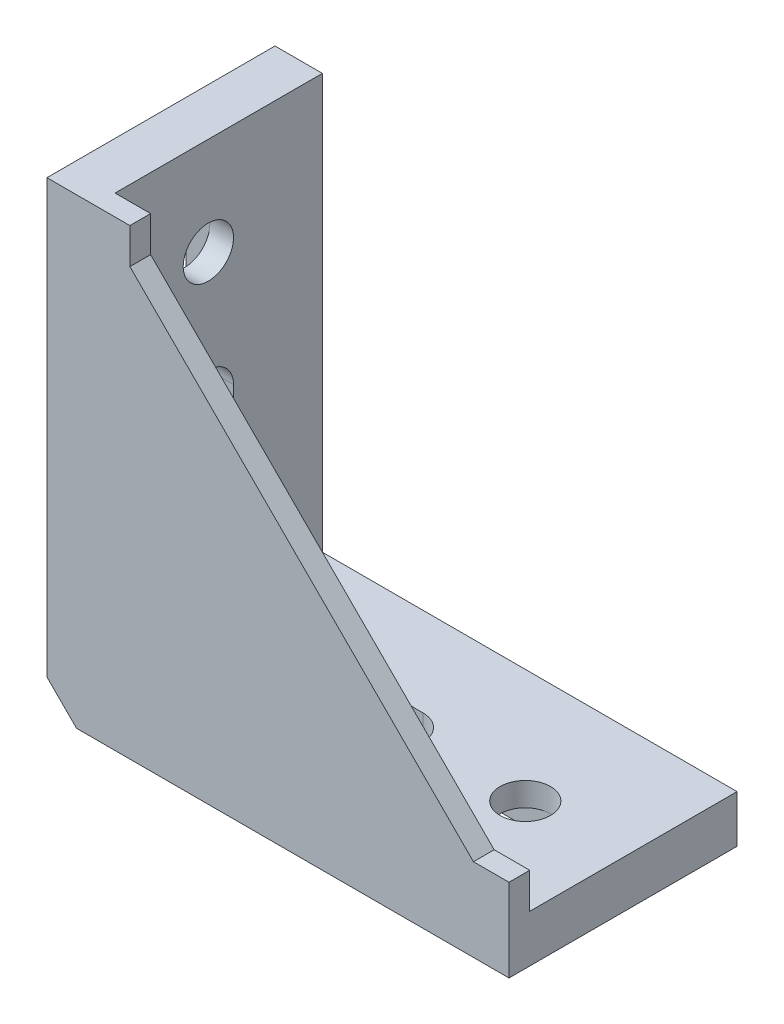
ISO-10303-21;
HEADER;
FILE_DESCRIPTION(('STEP AP214'),'2;1');
FILE_NAME('part.step','',(''),(''),'','','');
FILE_SCHEMA(('AUTOMOTIVE_DESIGN { 1 0 10303 214 1 1 1 1 }'));
ENDSEC;
DATA;
#1=APPLICATION_CONTEXT('core data for automotive mechanical design processes');
#2=APPLICATION_PROTOCOL_DEFINITION('international standard','automotive_design',2000,#1);
#3=PRODUCT_CONTEXT('',#1,'mechanical');
#4=PRODUCT('Part','Part','',(#3));
#5=PRODUCT_RELATED_PRODUCT_CATEGORY('part','',(#4));
#6=PRODUCT_DEFINITION_FORMATION('','',#4);
#7=PRODUCT_DEFINITION_CONTEXT('part definition',#1,'design');
#8=PRODUCT_DEFINITION('design','',#6,#7);
#9=PRODUCT_DEFINITION_SHAPE('','',#8);
#10=(LENGTH_UNIT() NAMED_UNIT(*) SI_UNIT(.MILLI.,.METRE.));
#11=(NAMED_UNIT(*) PLANE_ANGLE_UNIT() SI_UNIT($,.RADIAN.));
#12=(NAMED_UNIT(*) SI_UNIT($,.STERADIAN.) SOLID_ANGLE_UNIT());
#13=UNCERTAINTY_MEASURE_WITH_UNIT(LENGTH_MEASURE(1.E-05),#10,'distance_accuracy_value','');
#14=(GEOMETRIC_REPRESENTATION_CONTEXT(3) GLOBAL_UNCERTAINTY_ASSIGNED_CONTEXT((#13)) GLOBAL_UNIT_ASSIGNED_CONTEXT((#10,
#11,#12)) REPRESENTATION_CONTEXT('',''));
#15=CARTESIAN_POINT('',(0.,0.,0.));
#16=DIRECTION('',(0.,0.,1.));
#17=DIRECTION('',(1.,0.,0.));
#18=AXIS2_PLACEMENT_3D('',#15,#16,#17);
#19=CARTESIAN_POINT('',(-32.5064048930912,-32.7612033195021,38.5));
#20=DIRECTION('',(0.,-1.,0.));
#21=DIRECTION('',(0.,0.,-1.));
#22=AXIS2_PLACEMENT_3D('',#19,#20,#21);
#23=PLANE('',#22);
#24=DIRECTION('',(-1.,0.,0.));
#25=VECTOR('',#24,1.);
#26=CARTESIAN_POINT('',(-32.5064048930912,-32.7612033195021,15.));
#27=LINE('',#26,#25);
#28=CARTESIAN_POINT('',(-0.506404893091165,-32.7612033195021,15.));
#29=VERTEX_POINT('',#28);
#30=CARTESIAN_POINT('',(-18.5064048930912,-32.7612033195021,15.));
#31=VERTEX_POINT('',#30);
#32=EDGE_CURVE('E1675',#29,#31,#27,.T.);
#33=ORIENTED_EDGE('',*,*,#32,.F.);
#34=CARTESIAN_POINT('',(-0.506404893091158,-32.7612033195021,19.25));
#35=DIRECTION('',(0.,-1.,0.));
#36=DIRECTION('',(0.,0.,-1.));
#37=AXIS2_PLACEMENT_3D('',#34,#35,#36);
#38=CIRCLE('',#37,4.25);
#39=CARTESIAN_POINT('',(-0.506404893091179,-32.7612033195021,23.5));
#40=VERTEX_POINT('',#39);
#41=EDGE_CURVE('E1682',#40,#29,#38,.F.);
#42=ORIENTED_EDGE('',*,*,#41,.F.);
#43=DIRECTION('',(-1.,0.,0.));
#44=VECTOR('',#43,1.);
#45=CARTESIAN_POINT('',(-32.5064048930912,-32.7612033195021,23.5));
#46=LINE('',#45,#44);
#47=CARTESIAN_POINT('',(-18.5064048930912,-32.7612033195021,23.5));
#48=VERTEX_POINT('',#47);
#49=EDGE_CURVE('E1679',#40,#48,#46,.T.);
#50=ORIENTED_EDGE('',*,*,#49,.T.);
#51=CARTESIAN_POINT('',(-18.5064048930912,-32.7612033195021,19.25));
#52=DIRECTION('',(0.,-1.,0.));
#53=DIRECTION('',(0.,0.,-1.));
#54=AXIS2_PLACEMENT_3D('',#51,#52,#53);
#55=CIRCLE('',#54,4.25);
#56=EDGE_CURVE('E1677',#31,#48,#55,.F.);
#57=ORIENTED_EDGE('',*,*,#56,.F.);
#58=EDGE_LOOP('',(#33,#42,#50,#57));
#59=FACE_BOUND('',#58,.T.);
#60=DIRECTION('',(0.,0.,-1.));
#61=VECTOR('',#60,1.);
#62=CARTESIAN_POINT('',(-32.5064048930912,-32.7612033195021,38.5));
#63=LINE('',#62,#61);
#64=CARTESIAN_POINT('',(-32.5064048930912,-32.7612033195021,35.));
#65=VERTEX_POINT('',#64);
#66=CARTESIAN_POINT('',(-32.5064048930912,-32.7612033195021,0.));
#67=VERTEX_POINT('',#66);
#68=EDGE_CURVE('E723',#65,#67,#63,.T.);
#69=ORIENTED_EDGE('',*,*,#68,.F.);
#70=DIRECTION('',(1.,0.,0.));
#71=VECTOR('',#70,1.);
#72=CARTESIAN_POINT('',(37.4935951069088,-32.7612033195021,35.));
#73=LINE('',#72,#71);
#74=CARTESIAN_POINT('',(37.4935951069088,-32.7612033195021,35.));
#75=VERTEX_POINT('',#74);
#76=EDGE_CURVE('E789',#65,#75,#73,.T.);
#77=ORIENTED_EDGE('',*,*,#76,.T.);
#78=DIRECTION('',(0.,0.,-1.));
#79=VECTOR('',#78,1.);
#80=CARTESIAN_POINT('',(37.4935951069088,-32.7612033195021,38.5));
#81=LINE('',#80,#79);
#82=CARTESIAN_POINT('',(37.4935951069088,-32.7612033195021,0.));
#83=VERTEX_POINT('',#82);
#84=EDGE_CURVE('E721',#75,#83,#81,.T.);
#85=ORIENTED_EDGE('',*,*,#84,.T.);
#86=DIRECTION('',(-1.,0.,0.));
#87=VECTOR('',#86,1.);
#88=CARTESIAN_POINT('',(-32.5064048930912,-32.7612033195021,0.));
#89=LINE('',#88,#87);
#90=EDGE_CURVE('E737',#83,#67,#89,.T.);
#91=ORIENTED_EDGE('',*,*,#90,.T.);
#92=EDGE_LOOP('',(#69,#77,#85,#91));
#93=FACE_BOUND('',#92,.T.);
#94=CARTESIAN_POINT('',(20.9935951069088,-32.761203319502,19.25));
#95=DIRECTION('',(0.,-1.,0.));
#96=DIRECTION('',(0.,0.,-1.));
#97=AXIS2_PLACEMENT_3D('',#94,#95,#96);
#98=CIRCLE('',#97,4.25);
#99=CARTESIAN_POINT('',(20.9935951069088,-32.761203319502,15.));
#100=VERTEX_POINT('',#99);
#101=EDGE_CURVE('E1688',#100,#100,#98,.F.);
#102=ORIENTED_EDGE('',*,*,#101,.F.);
#103=EDGE_LOOP('',(#102));
#104=FACE_BOUND('',#103,.T.);
#105=ADVANCED_FACE('F30',(#59,#93,#104),#23,.F.);
#106=CARTESIAN_POINT('',(-29.5064048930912,-36.7612033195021,15.));
#107=DIRECTION('',(0.,-1.,0.));
#108=DIRECTION('',(0.,0.,1.));
#109=AXIS2_PLACEMENT_3D('',#106,#107,#108);
#110=PLANE('',#109);
#111=DIRECTION('',(-1.,0.,0.));
#112=VECTOR('',#111,1.);
#113=CARTESIAN_POINT('',(30.4935951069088,-36.7612033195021,15.));
#114=LINE('',#113,#112);
#115=CARTESIAN_POINT('',(20.9935951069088,-36.7612033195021,15.));
#116=VERTEX_POINT('',#115);
#117=CARTESIAN_POINT('',(-0.506404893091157,-36.7612033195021,15.));
#118=VERTEX_POINT('',#117);
#119=EDGE_CURVE('E1663',#116,#118,#114,.T.);
#120=ORIENTED_EDGE('',*,*,#119,.F.);
#121=CARTESIAN_POINT('',(20.9935951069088,-36.7612033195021,19.25));
#122=DIRECTION('',(0.,-1.,0.));
#123=DIRECTION('',(1.,0.,0.));
#124=AXIS2_PLACEMENT_3D('',#121,#122,#123);
#125=CIRCLE('',#124,4.25);
#126=CARTESIAN_POINT('',(20.9935951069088,-36.7612033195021,23.5));
#127=VERTEX_POINT('',#126);
#128=EDGE_CURVE('E1696',#116,#127,#125,.F.);
#129=ORIENTED_EDGE('',*,*,#128,.T.);
#130=DIRECTION('',(1.,0.,0.));
#131=VECTOR('',#130,1.);
#132=CARTESIAN_POINT('',(-29.5064048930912,-36.7612033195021,23.5));
#133=LINE('',#132,#131);
#134=CARTESIAN_POINT('',(-0.506404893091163,-36.7612033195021,23.5));
#135=VERTEX_POINT('',#134);
#136=EDGE_CURVE('E1668',#135,#127,#133,.T.);
#137=ORIENTED_EDGE('',*,*,#136,.F.);
#138=CARTESIAN_POINT('',(-0.506404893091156,-36.7612033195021,19.25));
#139=DIRECTION('',(0.,-1.,0.));
#140=DIRECTION('',(1.,0.,0.));
#141=AXIS2_PLACEMENT_3D('',#138,#139,#140);
#142=CIRCLE('',#141,4.25);
#143=EDGE_CURVE('E503',#135,#118,#142,.F.);
#144=ORIENTED_EDGE('',*,*,#143,.T.);
#145=EDGE_LOOP('',(#120,#129,#137,#144));
#146=FACE_BOUND('',#145,.T.);
#147=ADVANCED_FACE('F958',(#146),#110,.T.);
#148=CARTESIAN_POINT('',(30.4935951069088,-36.7612033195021,23.5));
#149=VERTEX_POINT('',#148);
#150=EDGE_CURVE('E1670',#127,#149,#133,.T.);
#151=ORIENTED_EDGE('',*,*,#150,.F.);
#152=EDGE_CURVE('E483',#127,#116,#125,.F.);
#153=ORIENTED_EDGE('',*,*,#152,.T.);
#154=CARTESIAN_POINT('',(30.4935951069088,-36.7612033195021,15.));
#155=VERTEX_POINT('',#154);
#156=EDGE_CURVE('E1665',#155,#116,#114,.T.);
#157=ORIENTED_EDGE('',*,*,#156,.F.);
#158=DIRECTION('',(0.,0.,-1.));
#159=VECTOR('',#158,1.);
#160=CARTESIAN_POINT('',(30.4935951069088,-36.7612033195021,15.));
#161=LINE('',#160,#159);
#162=EDGE_CURVE('E1672',#149,#155,#161,.T.);
#163=ORIENTED_EDGE('',*,*,#162,.F.);
#164=EDGE_LOOP('',(#151,#153,#157,#163));
#165=FACE_BOUND('',#164,.T.);
#166=ADVANCED_FACE('F964',(#165),#110,.T.);
#167=CARTESIAN_POINT('',(-18.5064048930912,-36.7612033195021,15.));
#168=VERTEX_POINT('',#167);
#169=CARTESIAN_POINT('',(-29.5064048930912,-36.7612033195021,15.));
#170=VERTEX_POINT('',#169);
#171=EDGE_CURVE('E525',#168,#170,#114,.T.);
#172=ORIENTED_EDGE('',*,*,#171,.F.);
#173=CARTESIAN_POINT('',(-18.5064048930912,-36.7612033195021,19.25));
#174=DIRECTION('',(0.,-1.,0.));
#175=DIRECTION('',(1.,0.,0.));
#176=AXIS2_PLACEMENT_3D('',#173,#174,#175);
#177=CIRCLE('',#176,4.25);
#178=CARTESIAN_POINT('',(-18.5064048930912,-36.7612033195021,23.5));
#179=VERTEX_POINT('',#178);
#180=EDGE_CURVE('E498',#168,#179,#177,.F.);
#181=ORIENTED_EDGE('',*,*,#180,.T.);
#182=CARTESIAN_POINT('',(-29.5064048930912,-36.7612033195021,23.5));
#183=VERTEX_POINT('',#182);
#184=EDGE_CURVE('E1666',#183,#179,#133,.T.);
#185=ORIENTED_EDGE('',*,*,#184,.F.);
#186=DIRECTION('',(0.,0.,1.));
#187=VECTOR('',#186,1.);
#188=CARTESIAN_POINT('',(-29.5064048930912,-36.7612033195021,15.));
#189=LINE('',#188,#187);
#190=EDGE_CURVE('E538',#170,#183,#189,.T.);
#191=ORIENTED_EDGE('',*,*,#190,.F.);
#192=EDGE_LOOP('',(#172,#181,#185,#191));
#193=FACE_BOUND('',#192,.T.);
#194=ADVANCED_FACE('F967',(#193),#110,.T.);
#195=CARTESIAN_POINT('',(37.4935951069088,-40.7612033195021,38.5));
#196=DIRECTION('',(0.,1.,0.));
#197=DIRECTION('',(-1.,0.,0.));
#198=AXIS2_PLACEMENT_3D('',#195,#196,#197);
#199=PLANE('',#198);
#200=DIRECTION('',(-1.,0.,0.));
#201=VECTOR('',#200,1.);
#202=CARTESIAN_POINT('',(-32.5064048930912,-40.7612033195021,26.5));
#203=LINE('',#202,#201);
#204=CARTESIAN_POINT('',(33.9935951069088,-40.7612033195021,26.5));
#205=VERTEX_POINT('',#204);
#206=CARTESIAN_POINT('',(-32.5064048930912,-40.7612033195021,26.5));
#207=VERTEX_POINT('',#206);
#208=EDGE_CURVE('E529',#205,#207,#203,.T.);
#209=ORIENTED_EDGE('',*,*,#208,.T.);
#210=DIRECTION('',(0.,0.,1.));
#211=VECTOR('',#210,1.);
#212=CARTESIAN_POINT('',(-32.5064048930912,-40.7612033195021,35.));
#213=LINE('',#212,#211);
#214=CARTESIAN_POINT('',(-32.5064048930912,-40.7612033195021,35.));
#215=VERTEX_POINT('',#214);
#216=EDGE_CURVE('E543',#207,#215,#213,.T.);
#217=ORIENTED_EDGE('',*,*,#216,.T.);
#218=DIRECTION('',(1.,0.,0.));
#219=VECTOR('',#218,1.);
#220=CARTESIAN_POINT('',(33.9935951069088,-40.7612033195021,35.));
#221=LINE('',#220,#219);
#222=CARTESIAN_POINT('',(33.9935951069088,-40.7612033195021,35.));
#223=VERTEX_POINT('',#222);
#224=EDGE_CURVE('E555',#215,#223,#221,.T.);
#225=ORIENTED_EDGE('',*,*,#224,.T.);
#226=DIRECTION('',(0.,0.,-1.));
#227=VECTOR('',#226,1.);
#228=CARTESIAN_POINT('',(33.9935951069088,-40.7612033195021,26.5));
#229=LINE('',#228,#227);
#230=EDGE_CURVE('E552',#223,#205,#229,.T.);
#231=ORIENTED_EDGE('',*,*,#230,.T.);
#232=EDGE_LOOP('',(#209,#217,#225,#231));
#233=FACE_BOUND('',#232,.T.);
#234=DIRECTION('',(1.,0.,0.));
#235=VECTOR('',#234,1.);
#236=CARTESIAN_POINT('',(37.4935951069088,-40.7612033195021,38.5));
#237=LINE('',#236,#235);
#238=CARTESIAN_POINT('',(-35.5064048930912,-40.7612033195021,38.5));
#239=VERTEX_POINT('',#238);
#240=CARTESIAN_POINT('',(37.4935951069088,-40.7612033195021,38.5));
#241=VERTEX_POINT('',#240);
#242=EDGE_CURVE('E751',#239,#241,#237,.T.);
#243=ORIENTED_EDGE('',*,*,#242,.F.);
#244=DIRECTION('',(0.,0.,-1.));
#245=VECTOR('',#244,1.);
#246=CARTESIAN_POINT('',(-35.5064048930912,-40.7612033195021,38.5));
#247=LINE('',#246,#245);
#248=CARTESIAN_POINT('',(-35.5064048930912,-40.7612033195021,0.));
#249=VERTEX_POINT('',#248);
#250=EDGE_CURVE('E495',#239,#249,#247,.T.);
#251=ORIENTED_EDGE('',*,*,#250,.T.);
#252=DIRECTION('',(1.,0.,0.));
#253=VECTOR('',#252,1.);
#254=CARTESIAN_POINT('',(37.4935951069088,-40.7612033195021,0.));
#255=LINE('',#254,#253);
#256=CARTESIAN_POINT('',(37.4935951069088,-40.7612033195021,0.));
#257=VERTEX_POINT('',#256);
#258=EDGE_CURVE('E743',#249,#257,#255,.T.);
#259=ORIENTED_EDGE('',*,*,#258,.T.);
#260=DIRECTION('',(0.,0.,-1.));
#261=VECTOR('',#260,1.);
#262=CARTESIAN_POINT('',(37.4935951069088,-40.7612033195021,38.5));
#263=LINE('',#262,#261);
#264=EDGE_CURVE('E718',#241,#257,#263,.T.);
#265=ORIENTED_EDGE('',*,*,#264,.F.);
#266=EDGE_LOOP('',(#243,#251,#259,#265));
#267=FACE_BOUND('',#266,.T.);
#268=DIRECTION('',(-1.,0.,0.));
#269=VECTOR('',#268,1.);
#270=CARTESIAN_POINT('',(-32.5064048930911,-40.7612033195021,3.));
#271=LINE('',#270,#269);
#272=CARTESIAN_POINT('',(33.9935951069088,-40.7612033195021,3.));
#273=VERTEX_POINT('',#272);
#274=CARTESIAN_POINT('',(-32.5064048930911,-40.7612033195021,3.));
#275=VERTEX_POINT('',#274);
#276=EDGE_CURVE('E563',#273,#275,#271,.T.);
#277=ORIENTED_EDGE('',*,*,#276,.T.);
#278=DIRECTION('',(0.,0.,1.));
#279=VECTOR('',#278,1.);
#280=CARTESIAN_POINT('',(-32.5064048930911,-40.7612033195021,11.5));
#281=LINE('',#280,#279);
#282=CARTESIAN_POINT('',(-32.5064048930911,-40.7612033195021,11.5));
#283=VERTEX_POINT('',#282);
#284=EDGE_CURVE('E574',#275,#283,#281,.T.);
#285=ORIENTED_EDGE('',*,*,#284,.T.);
#286=DIRECTION('',(1.,0.,0.));
#287=VECTOR('',#286,1.);
#288=CARTESIAN_POINT('',(33.9935951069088,-40.7612033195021,11.5));
#289=LINE('',#288,#287);
#290=CARTESIAN_POINT('',(33.9935951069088,-40.7612033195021,11.5));
#291=VERTEX_POINT('',#290);
#292=EDGE_CURVE('E586',#283,#291,#289,.T.);
#293=ORIENTED_EDGE('',*,*,#292,.T.);
#294=DIRECTION('',(0.,0.,-1.));
#295=VECTOR('',#294,1.);
#296=CARTESIAN_POINT('',(33.9935951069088,-40.7612033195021,3.));
#297=LINE('',#296,#295);
#298=EDGE_CURVE('E583',#291,#273,#297,.T.);
#299=ORIENTED_EDGE('',*,*,#298,.T.);
#300=EDGE_LOOP('',(#277,#285,#293,#299));
#301=FACE_BOUND('',#300,.T.);
#302=DIRECTION('',(0.,0.,1.));
#303=VECTOR('',#302,1.);
#304=CARTESIAN_POINT('',(-32.724436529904,-40.7612033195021,15.35));
#305=LINE('',#304,#303);
#306=CARTESIAN_POINT('',(-32.724436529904,-40.7612033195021,15.35));
#307=VERTEX_POINT('',#306);
#308=CARTESIAN_POINT('',(-32.724436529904,-40.7612033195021,23.15));
#309=VERTEX_POINT('',#308);
#310=EDGE_CURVE('E448',#307,#309,#305,.T.);
#311=ORIENTED_EDGE('',*,*,#310,.T.);
#312=DIRECTION('',(1.,0.,0.));
#313=VECTOR('',#312,1.);
#314=CARTESIAN_POINT('',(-32.724436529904,-40.7612033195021,23.15));
#315=LINE('',#314,#313);
#316=CARTESIAN_POINT('',(-29.5064048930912,-40.7612033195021,23.15));
#317=VERTEX_POINT('',#316);
#318=EDGE_CURVE('E446',#309,#317,#315,.T.);
#319=ORIENTED_EDGE('',*,*,#318,.T.);
#320=DIRECTION('',(0.,0.,1.));
#321=VECTOR('',#320,1.);
#322=CARTESIAN_POINT('',(-29.5064048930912,-40.7612033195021,15.));
#323=LINE('',#322,#321);
#324=CARTESIAN_POINT('',(-29.5064048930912,-40.7612033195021,23.5));
#325=VERTEX_POINT('',#324);
#326=EDGE_CURVE('E420',#317,#325,#323,.T.);
#327=ORIENTED_EDGE('',*,*,#326,.T.);
#328=DIRECTION('',(1.,0.,0.));
#329=VECTOR('',#328,1.);
#330=CARTESIAN_POINT('',(-29.5064048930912,-40.7612033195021,23.5));
#331=LINE('',#330,#329);
#332=CARTESIAN_POINT('',(30.4935951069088,-40.7612033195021,23.5));
#333=VERTEX_POINT('',#332);
#334=EDGE_CURVE('E515',#325,#333,#331,.T.);
#335=ORIENTED_EDGE('',*,*,#334,.T.);
#336=DIRECTION('',(0.,0.,-1.));
#337=VECTOR('',#336,1.);
#338=CARTESIAN_POINT('',(30.4935951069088,-40.7612033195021,15.));
#339=LINE('',#338,#337);
#340=CARTESIAN_POINT('',(30.4935951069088,-40.7612033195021,23.15));
#341=VERTEX_POINT('',#340);
#342=EDGE_CURVE('E513',#333,#341,#339,.T.);
#343=ORIENTED_EDGE('',*,*,#342,.T.);
#344=DIRECTION('',(1.,0.,0.));
#345=VECTOR('',#344,1.);
#346=CARTESIAN_POINT('',(33.5061252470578,-40.7612033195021,23.15));
#347=LINE('',#346,#345);
#348=CARTESIAN_POINT('',(33.5061252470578,-40.7612033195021,23.15));
#349=VERTEX_POINT('',#348);
#350=EDGE_CURVE('E460',#341,#349,#347,.T.);
#351=ORIENTED_EDGE('',*,*,#350,.T.);
#352=DIRECTION('',(0.,0.,-1.));
#353=VECTOR('',#352,1.);
#354=CARTESIAN_POINT('',(33.5061252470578,-40.7612033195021,15.35));
#355=LINE('',#354,#353);
#356=CARTESIAN_POINT('',(33.5061252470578,-40.7612033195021,15.35));
#357=VERTEX_POINT('',#356);
#358=EDGE_CURVE('E472',#349,#357,#355,.T.);
#359=ORIENTED_EDGE('',*,*,#358,.T.);
#360=DIRECTION('',(-1.,0.,0.));
#361=VECTOR('',#360,1.);
#362=CARTESIAN_POINT('',(30.4935951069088,-40.7612033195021,15.35));
#363=LINE('',#362,#361);
#364=CARTESIAN_POINT('',(30.4935951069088,-40.7612033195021,15.35));
#365=VERTEX_POINT('',#364);
#366=EDGE_CURVE('E425',#357,#365,#363,.T.);
#367=ORIENTED_EDGE('',*,*,#366,.T.);
#368=CARTESIAN_POINT('',(30.4935951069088,-40.7612033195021,15.));
#369=VERTEX_POINT('',#368);
#370=EDGE_CURVE('E478',#365,#369,#339,.T.);
#371=ORIENTED_EDGE('',*,*,#370,.T.);
#372=DIRECTION('',(-1.,0.,0.));
#373=VECTOR('',#372,1.);
#374=CARTESIAN_POINT('',(30.4935951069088,-40.7612033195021,15.));
#375=LINE('',#374,#373);
#376=CARTESIAN_POINT('',(-29.5064048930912,-40.7612033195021,15.));
#377=VERTEX_POINT('',#376);
#378=EDGE_CURVE('E519',#369,#377,#375,.T.);
#379=ORIENTED_EDGE('',*,*,#378,.T.);
#380=CARTESIAN_POINT('',(-29.5064048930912,-40.7612033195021,15.35));
#381=VERTEX_POINT('',#380);
#382=EDGE_CURVE('E523',#377,#381,#323,.T.);
#383=ORIENTED_EDGE('',*,*,#382,.T.);
#384=DIRECTION('',(-1.,0.,0.));
#385=VECTOR('',#384,1.);
#386=CARTESIAN_POINT('',(-29.5064048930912,-40.7612033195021,15.35));
#387=LINE('',#386,#385);
#388=EDGE_CURVE('E436',#381,#307,#387,.T.);
#389=ORIENTED_EDGE('',*,*,#388,.T.);
#390=EDGE_LOOP('',(#311,#319,#327,#335,#343,#351,#359,#367,#371,#379,#383,#389));
#391=FACE_BOUND('',#390,.T.);
#392=ADVANCED_FACE('F978',(#233,#267,#301,#391),#199,.F.);
#393=CARTESIAN_POINT('',(-40.5064048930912,-40.7612033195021,38.5));
#394=DIRECTION('',(1.,0.,0.));
#395=DIRECTION('',(0.,0.,-1.));
#396=AXIS2_PLACEMENT_3D('',#393,#394,#395);
#397=PLANE('',#396);
#398=DIRECTION('',(0.,0.,1.));
#399=VECTOR('',#398,1.);
#400=CARTESIAN_POINT('',(-40.5064048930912,-32.7612033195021,35.));
#401=LINE('',#400,#399);
#402=CARTESIAN_POINT('',(-40.5064048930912,-32.7612033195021,26.5));
#403=VERTEX_POINT('',#402);
#404=CARTESIAN_POINT('',(-40.5064048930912,-32.7612033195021,35.));
#405=VERTEX_POINT('',#404);
#406=EDGE_CURVE('E856',#403,#405,#401,.T.);
#407=ORIENTED_EDGE('',*,*,#406,.F.);
#408=DIRECTION('',(0.,-1.,0.));
#409=VECTOR('',#408,1.);
#410=CARTESIAN_POINT('',(-40.5064048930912,-32.7612033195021,26.5));
#411=LINE('',#410,#409);
#412=CARTESIAN_POINT('',(-40.5064048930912,33.7387966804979,26.5));
#413=VERTEX_POINT('',#412);
#414=EDGE_CURVE('E859',#413,#403,#411,.T.);
#415=ORIENTED_EDGE('',*,*,#414,.F.);
#416=DIRECTION('',(0.,0.,-1.));
#417=VECTOR('',#416,1.);
#418=CARTESIAN_POINT('',(-40.5064048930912,33.7387966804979,26.5));
#419=LINE('',#418,#417);
#420=CARTESIAN_POINT('',(-40.5064048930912,33.7387966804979,35.));
#421=VERTEX_POINT('',#420);
#422=EDGE_CURVE('E849',#421,#413,#419,.T.);
#423=ORIENTED_EDGE('',*,*,#422,.F.);
#424=DIRECTION('',(0.,1.,0.));
#425=VECTOR('',#424,1.);
#426=CARTESIAN_POINT('',(-40.5064048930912,33.7387966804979,35.));
#427=LINE('',#426,#425);
#428=EDGE_CURVE('E853',#405,#421,#427,.T.);
#429=ORIENTED_EDGE('',*,*,#428,.F.);
#430=EDGE_LOOP('',(#407,#415,#423,#429));
#431=FACE_BOUND('',#430,.T.);
#432=DIRECTION('',(0.,0.,1.));
#433=VECTOR('',#432,1.);
#434=CARTESIAN_POINT('',(-40.5064048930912,-32.7612033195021,11.5));
#435=LINE('',#434,#433);
#436=CARTESIAN_POINT('',(-40.5064048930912,-32.7612033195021,3.));
#437=VERTEX_POINT('',#436);
#438=CARTESIAN_POINT('',(-40.5064048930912,-32.7612033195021,11.5));
#439=VERTEX_POINT('',#438);
#440=EDGE_CURVE('E824',#437,#439,#435,.T.);
#441=ORIENTED_EDGE('',*,*,#440,.F.);
#442=DIRECTION('',(0.,-1.,0.));
#443=VECTOR('',#442,1.);
#444=CARTESIAN_POINT('',(-40.5064048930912,-32.7612033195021,3.));
#445=LINE('',#444,#443);
#446=CARTESIAN_POINT('',(-40.5064048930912,33.7387966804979,3.));
#447=VERTEX_POINT('',#446);
#448=EDGE_CURVE('E827',#447,#437,#445,.T.);
#449=ORIENTED_EDGE('',*,*,#448,.F.);
#450=DIRECTION('',(0.,0.,-1.));
#451=VECTOR('',#450,1.);
#452=CARTESIAN_POINT('',(-40.5064048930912,33.7387966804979,3.));
#453=LINE('',#452,#451);
#454=CARTESIAN_POINT('',(-40.5064048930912,33.7387966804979,11.5));
#455=VERTEX_POINT('',#454);
#456=EDGE_CURVE('E817',#455,#447,#453,.T.);
#457=ORIENTED_EDGE('',*,*,#456,.F.);
#458=DIRECTION('',(0.,1.,0.));
#459=VECTOR('',#458,1.);
#460=CARTESIAN_POINT('',(-40.5064048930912,33.7387966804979,11.5));
#461=LINE('',#460,#459);
#462=EDGE_CURVE('E821',#439,#455,#461,.T.);
#463=ORIENTED_EDGE('',*,*,#462,.F.);
#464=EDGE_LOOP('',(#441,#449,#457,#463));
#465=FACE_BOUND('',#464,.T.);
#466=DIRECTION('',(0.,-1.,0.));
#467=VECTOR('',#466,1.);
#468=CARTESIAN_POINT('',(-40.5064048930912,-40.7612033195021,0.));
#469=LINE('',#468,#467);
#470=CARTESIAN_POINT('',(-40.5064048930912,37.2387966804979,0.));
#471=VERTEX_POINT('',#470);
#472=CARTESIAN_POINT('',(-40.5064048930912,-35.7612033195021,0.));
#473=VERTEX_POINT('',#472);
#474=EDGE_CURVE('E745',#471,#473,#469,.T.);
#475=ORIENTED_EDGE('',*,*,#474,.T.);
#476=DIRECTION('',(0.,0.,1.));
#477=VECTOR('',#476,1.);
#478=CARTESIAN_POINT('',(-40.5064048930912,-35.7612033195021,38.5));
#479=LINE('',#478,#477);
#480=CARTESIAN_POINT('',(-40.5064048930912,-35.7612033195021,38.5));
#481=VERTEX_POINT('',#480);
#482=EDGE_CURVE('E38',#473,#481,#479,.T.);
#483=ORIENTED_EDGE('',*,*,#482,.T.);
#484=DIRECTION('',(0.,-1.,0.));
#485=VECTOR('',#484,1.);
#486=CARTESIAN_POINT('',(-40.5064048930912,-40.7612033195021,38.5));
#487=LINE('',#486,#485);
#488=CARTESIAN_POINT('',(-40.5064048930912,37.2387966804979,38.5));
#489=VERTEX_POINT('',#488);
#490=EDGE_CURVE('E733',#489,#481,#487,.T.);
#491=ORIENTED_EDGE('',*,*,#490,.F.);
#492=DIRECTION('',(0.,0.,-1.));
#493=VECTOR('',#492,1.);
#494=CARTESIAN_POINT('',(-40.5064048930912,37.2387966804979,38.5));
#495=LINE('',#494,#493);
#496=EDGE_CURVE('E727',#489,#471,#495,.T.);
#497=ORIENTED_EDGE('',*,*,#496,.T.);
#498=EDGE_LOOP('',(#475,#483,#491,#497));
#499=FACE_BOUND('',#498,.T.);
#500=DIRECTION('',(0.,-1.,0.));
#501=VECTOR('',#500,1.);
#502=CARTESIAN_POINT('',(-40.5064048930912,-29.7612033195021,15.35));
#503=LINE('',#502,#501);
#504=CARTESIAN_POINT('',(-40.5064048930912,-29.7612033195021,15.35));
#505=VERTEX_POINT('',#504);
#506=CARTESIAN_POINT('',(-40.5064048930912,-32.9792349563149,15.35));
#507=VERTEX_POINT('',#506);
#508=EDGE_CURVE('E594',#505,#507,#503,.T.);
#509=ORIENTED_EDGE('',*,*,#508,.F.);
#510=DIRECTION('',(0.,0.,1.));
#511=VECTOR('',#510,1.);
#512=CARTESIAN_POINT('',(-40.5064048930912,-29.7612033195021,15.));
#513=LINE('',#512,#511);
#514=CARTESIAN_POINT('',(-40.5064048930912,-29.7612033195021,15.));
#515=VERTEX_POINT('',#514);
#516=EDGE_CURVE('E684',#515,#505,#513,.T.);
#517=ORIENTED_EDGE('',*,*,#516,.F.);
#518=DIRECTION('',(0.,-1.,0.));
#519=VECTOR('',#518,1.);
#520=CARTESIAN_POINT('',(-40.5064048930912,-69.5604494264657,15.));
#521=LINE('',#520,#519);
#522=CARTESIAN_POINT('',(-40.5064048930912,30.2387966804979,15.));
#523=VERTEX_POINT('',#522);
#524=EDGE_CURVE('E705',#523,#515,#521,.T.);
#525=ORIENTED_EDGE('',*,*,#524,.F.);
#526=DIRECTION('',(0.,0.,-1.));
#527=VECTOR('',#526,1.);
#528=CARTESIAN_POINT('',(-40.5064048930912,30.2387966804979,15.));
#529=LINE('',#528,#527);
#530=CARTESIAN_POINT('',(-40.5064048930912,30.2387966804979,15.35));
#531=VERTEX_POINT('',#530);
#532=EDGE_CURVE('E687',#531,#523,#529,.T.);
#533=ORIENTED_EDGE('',*,*,#532,.F.);
#534=DIRECTION('',(0.,-1.,0.));
#535=VECTOR('',#534,1.);
#536=CARTESIAN_POINT('',(-40.5064048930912,30.2387966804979,15.35));
#537=LINE('',#536,#535);
#538=CARTESIAN_POINT('',(-40.5064048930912,33.2513268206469,15.35));
#539=VERTEX_POINT('',#538);
#540=EDGE_CURVE('E631',#539,#531,#537,.T.);
#541=ORIENTED_EDGE('',*,*,#540,.F.);
#542=DIRECTION('',(0.,0.,-1.));
#543=VECTOR('',#542,1.);
#544=CARTESIAN_POINT('',(-40.5064048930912,33.2513268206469,15.35));
#545=LINE('',#544,#543);
#546=CARTESIAN_POINT('',(-40.5064048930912,33.2513268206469,23.15));
#547=VERTEX_POINT('',#546);
#548=EDGE_CURVE('E638',#547,#539,#545,.T.);
#549=ORIENTED_EDGE('',*,*,#548,.F.);
#550=DIRECTION('',(0.,1.,0.));
#551=VECTOR('',#550,1.);
#552=CARTESIAN_POINT('',(-40.5064048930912,33.2513268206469,23.15));
#553=LINE('',#552,#551);
#554=CARTESIAN_POINT('',(-40.5064048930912,30.2387966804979,23.15));
#555=VERTEX_POINT('',#554);
#556=EDGE_CURVE('E626',#555,#547,#553,.T.);
#557=ORIENTED_EDGE('',*,*,#556,.F.);
#558=CARTESIAN_POINT('',(-40.5064048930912,30.2387966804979,23.5));
#559=VERTEX_POINT('',#558);
#560=EDGE_CURVE('E696',#559,#555,#529,.T.);
#561=ORIENTED_EDGE('',*,*,#560,.F.);
#562=DIRECTION('',(0.,-1.,0.));
#563=VECTOR('',#562,1.);
#564=CARTESIAN_POINT('',(-40.5064048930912,-69.5604494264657,23.5));
#565=LINE('',#564,#563);
#566=CARTESIAN_POINT('',(-40.5064048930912,-29.7612033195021,23.5));
#567=VERTEX_POINT('',#566);
#568=EDGE_CURVE('E798',#559,#567,#565,.T.);
#569=ORIENTED_EDGE('',*,*,#568,.T.);
#570=CARTESIAN_POINT('',(-40.5064048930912,-29.7612033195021,23.15));
#571=VERTEX_POINT('',#570);
#572=EDGE_CURVE('E667',#571,#567,#513,.T.);
#573=ORIENTED_EDGE('',*,*,#572,.F.);
#574=DIRECTION('',(0.,1.,0.));
#575=VECTOR('',#574,1.);
#576=CARTESIAN_POINT('',(-40.5064048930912,-32.9792349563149,23.15));
#577=LINE('',#576,#575);
#578=CARTESIAN_POINT('',(-40.5064048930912,-32.9792349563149,23.15));
#579=VERTEX_POINT('',#578);
#580=EDGE_CURVE('E605',#579,#571,#577,.T.);
#581=ORIENTED_EDGE('',*,*,#580,.F.);
#582=DIRECTION('',(0.,0.,1.));
#583=VECTOR('',#582,1.);
#584=CARTESIAN_POINT('',(-40.5064048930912,-32.9792349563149,15.35));
#585=LINE('',#584,#583);
#586=EDGE_CURVE('E613',#507,#579,#585,.T.);
#587=ORIENTED_EDGE('',*,*,#586,.F.);
#588=EDGE_LOOP('',(#509,#517,#525,#533,#541,#549,#557,#561,#569,#573,#581,#587));
#589=FACE_BOUND('',#588,.T.);
#590=ADVANCED_FACE('F896',(#431,#465,#499,#589),#397,.F.);
#591=CARTESIAN_POINT('',(37.4935951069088,-0.761203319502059,19.25));
#592=DIRECTION('',(-1.,0.,0.));
#593=DIRECTION('',(0.,0.,1.));
#594=AXIS2_PLACEMENT_3D('',#591,#592,#593);
#595=CYLINDRICAL_SURFACE('',#594,4.25);
#596=CARTESIAN_POINT('',(-36.5064048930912,-0.761203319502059,19.25));
#597=DIRECTION('',(-1.,0.,0.));
#598=DIRECTION('',(0.,0.,1.));
#599=AXIS2_PLACEMENT_3D('',#596,#597,#598);
#600=CIRCLE('',#599,4.25);
#601=CARTESIAN_POINT('',(-36.5064048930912,-0.761203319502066,15.));
#602=VERTEX_POINT('',#601);
#603=CARTESIAN_POINT('',(-36.5064048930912,-0.761203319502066,23.5));
#604=VERTEX_POINT('',#603);
#605=EDGE_CURVE('E861',#602,#604,#600,.F.);
#606=ORIENTED_EDGE('',*,*,#605,.F.);
#607=DIRECTION('',(-1.,0.,0.));
#608=VECTOR('',#607,1.);
#609=CARTESIAN_POINT('',(37.4935951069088,-0.761203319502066,15.));
#610=LINE('',#609,#608);
#611=CARTESIAN_POINT('',(-32.5064048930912,-0.761203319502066,15.));
#612=VERTEX_POINT('',#611);
#613=EDGE_CURVE('E774',#612,#602,#610,.T.);
#614=ORIENTED_EDGE('',*,*,#613,.F.);
#615=CARTESIAN_POINT('',(-32.5064048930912,-0.761203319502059,19.25));
#616=DIRECTION('',(-1.,0.,0.));
#617=DIRECTION('',(0.,0.,1.));
#618=AXIS2_PLACEMENT_3D('',#615,#616,#617);
#619=CIRCLE('',#618,4.25);
#620=CARTESIAN_POINT('',(-32.5064048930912,-0.761203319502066,23.5));
#621=VERTEX_POINT('',#620);
#622=EDGE_CURVE('E709',#621,#612,#619,.T.);
#623=ORIENTED_EDGE('',*,*,#622,.F.);
#624=DIRECTION('',(-1.,0.,0.));
#625=VECTOR('',#624,1.);
#626=CARTESIAN_POINT('',(37.4935951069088,-0.761203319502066,23.5));
#627=LINE('',#626,#625);
#628=EDGE_CURVE('E801',#621,#604,#627,.T.);
#629=ORIENTED_EDGE('',*,*,#628,.T.);
#630=EDGE_LOOP('',(#606,#614,#623,#629));
#631=FACE_BOUND('',#630,.T.);
#632=ADVANCED_FACE('F915',(#631),#595,.F.);
#633=CARTESIAN_POINT('',(37.4935951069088,-18.7612033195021,19.25));
#634=DIRECTION('',(-1.,0.,0.));
#635=DIRECTION('',(0.,0.,1.));
#636=AXIS2_PLACEMENT_3D('',#633,#634,#635);
#637=CYLINDRICAL_SURFACE('',#636,4.25);
#638=CARTESIAN_POINT('',(-36.5064048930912,-18.7612033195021,19.25));
#639=DIRECTION('',(-1.,0.,0.));
#640=DIRECTION('',(0.,0.,1.));
#641=AXIS2_PLACEMENT_3D('',#638,#639,#640);
#642=CIRCLE('',#641,4.25);
#643=CARTESIAN_POINT('',(-36.5064048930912,-18.7612033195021,23.5));
#644=VERTEX_POINT('',#643);
#645=CARTESIAN_POINT('',(-36.5064048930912,-18.7612033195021,15.));
#646=VERTEX_POINT('',#645);
#647=EDGE_CURVE('E873',#644,#646,#642,.F.);
#648=ORIENTED_EDGE('',*,*,#647,.F.);
#649=DIRECTION('',(-1.,0.,0.));
#650=VECTOR('',#649,1.);
#651=CARTESIAN_POINT('',(37.4935951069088,-18.7612033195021,23.5));
#652=LINE('',#651,#650);
#653=CARTESIAN_POINT('',(-32.5064048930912,-18.7612033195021,23.5));
#654=VERTEX_POINT('',#653);
#655=EDGE_CURVE('E797',#654,#644,#652,.T.);
#656=ORIENTED_EDGE('',*,*,#655,.F.);
#657=CARTESIAN_POINT('',(-32.5064048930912,-18.7612033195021,19.25));
#658=DIRECTION('',(-1.,0.,0.));
#659=DIRECTION('',(0.,0.,1.));
#660=AXIS2_PLACEMENT_3D('',#657,#658,#659);
#661=CIRCLE('',#660,4.25);
#662=CARTESIAN_POINT('',(-32.5064048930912,-18.7612033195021,15.));
#663=VERTEX_POINT('',#662);
#664=EDGE_CURVE('E715',#663,#654,#661,.T.);
#665=ORIENTED_EDGE('',*,*,#664,.F.);
#666=DIRECTION('',(-1.,0.,0.));
#667=VECTOR('',#666,1.);
#668=CARTESIAN_POINT('',(37.4935951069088,-18.7612033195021,15.));
#669=LINE('',#668,#667);
#670=EDGE_CURVE('E794',#663,#646,#669,.T.);
#671=ORIENTED_EDGE('',*,*,#670,.T.);
#672=EDGE_LOOP('',(#648,#656,#665,#671));
#673=FACE_BOUND('',#672,.T.);
#674=ADVANCED_FACE('F907',(#673),#637,.F.);
#675=CARTESIAN_POINT('',(37.4935951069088,20.7387966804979,19.25));
#676=DIRECTION('',(-1.,0.,0.));
#677=DIRECTION('',(0.,0.,1.));
#678=AXIS2_PLACEMENT_3D('',#675,#676,#677);
#679=CYLINDRICAL_SURFACE('',#678,4.25);
#680=CARTESIAN_POINT('',(-32.5064048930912,20.7387966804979,19.25));
#681=DIRECTION('',(-1.,0.,0.));
#682=DIRECTION('',(0.,0.,1.));
#683=AXIS2_PLACEMENT_3D('',#680,#681,#682);
#684=CIRCLE('',#683,4.25);
#685=CARTESIAN_POINT('',(-32.5064048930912,20.7387966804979,23.5));
#686=VERTEX_POINT('',#685);
#687=EDGE_CURVE('E702',#686,#686,#684,.T.);
#688=ORIENTED_EDGE('',*,*,#687,.F.);
#689=EDGE_LOOP('',(#688));
#690=FACE_BOUND('',#689,.T.);
#691=CARTESIAN_POINT('',(-36.5064048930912,20.7387966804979,19.25));
#692=DIRECTION('',(-1.,0.,0.));
#693=DIRECTION('',(0.,0.,1.));
#694=AXIS2_PLACEMENT_3D('',#691,#692,#693);
#695=CIRCLE('',#694,4.25);
#696=CARTESIAN_POINT('',(-36.5064048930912,20.7387966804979,23.5));
#697=VERTEX_POINT('',#696);
#698=CARTESIAN_POINT('',(-36.5064048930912,20.7387966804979,15.));
#699=VERTEX_POINT('',#698);
#700=EDGE_CURVE('E510',#697,#699,#695,.F.);
#701=ORIENTED_EDGE('',*,*,#700,.F.);
#702=EDGE_CURVE('E699',#699,#697,#695,.F.);
#703=ORIENTED_EDGE('',*,*,#702,.F.);
#704=EDGE_LOOP('',(#701,#703));
#705=FACE_BOUND('',#704,.T.);
#706=ADVANCED_FACE('F976',(#690,#705),#679,.F.);
#707=CARTESIAN_POINT('',(37.4935951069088,-32.7612033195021,38.5));
#708=DIRECTION('',(-1.,0.,0.));
#709=DIRECTION('',(0.,-1.,0.));
#710=AXIS2_PLACEMENT_3D('',#707,#708,#709);
#711=PLANE('',#710);
#712=DIRECTION('',(0.,1.,0.));
#713=VECTOR('',#712,1.);
#714=CARTESIAN_POINT('',(37.4935951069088,-32.7612033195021,0.));
#715=LINE('',#714,#713);
#716=EDGE_CURVE('E740',#257,#83,#715,.T.);
#717=ORIENTED_EDGE('',*,*,#716,.T.);
#718=ORIENTED_EDGE('',*,*,#84,.F.);
#719=DIRECTION('',(0.,1.,0.));
#720=VECTOR('',#719,1.);
#721=CARTESIAN_POINT('',(37.4935951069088,-26.7612033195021,35.));
#722=LINE('',#721,#720);
#723=CARTESIAN_POINT('',(37.4935951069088,-26.7612033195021,35.));
#724=VERTEX_POINT('',#723);
#725=EDGE_CURVE('E786',#75,#724,#722,.T.);
#726=ORIENTED_EDGE('',*,*,#725,.T.);
#727=DIRECTION('',(0.,0.,1.));
#728=VECTOR('',#727,1.);
#729=CARTESIAN_POINT('',(37.4935951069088,-26.7612033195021,35.));
#730=LINE('',#729,#728);
#731=CARTESIAN_POINT('',(37.4935951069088,-26.7612033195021,38.5));
#732=VERTEX_POINT('',#731);
#733=EDGE_CURVE('E754',#724,#732,#730,.T.);
#734=ORIENTED_EDGE('',*,*,#733,.T.);
#735=DIRECTION('',(0.,1.,0.));
#736=VECTOR('',#735,1.);
#737=CARTESIAN_POINT('',(37.4935951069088,-32.7612033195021,38.5));
#738=LINE('',#737,#736);
#739=EDGE_CURVE('E749',#241,#732,#738,.T.);
#740=ORIENTED_EDGE('',*,*,#739,.F.);
#741=ORIENTED_EDGE('',*,*,#264,.T.);
#742=EDGE_LOOP('',(#717,#718,#726,#734,#740,#741));
#743=FACE_BOUND('',#742,.T.);
#744=ADVANCED_FACE('F973',(#743),#711,.F.);
#745=CARTESIAN_POINT('',(-32.5064048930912,37.2387966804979,38.5));
#746=DIRECTION('',(-1.,0.,0.));
#747=DIRECTION('',(0.,0.,1.));
#748=AXIS2_PLACEMENT_3D('',#745,#746,#747);
#749=PLANE('',#748);
#750=ORIENTED_EDGE('',*,*,#687,.T.);
#751=EDGE_LOOP('',(#750));
#752=FACE_BOUND('',#751,.T.);
#753=ORIENTED_EDGE('',*,*,#622,.T.);
#754=DIRECTION('',(0.,-1.,0.));
#755=VECTOR('',#754,1.);
#756=CARTESIAN_POINT('',(-32.5064048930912,37.2387966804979,15.));
#757=LINE('',#756,#755);
#758=EDGE_CURVE('E701',#612,#663,#757,.T.);
#759=ORIENTED_EDGE('',*,*,#758,.T.);
#760=ORIENTED_EDGE('',*,*,#664,.T.);
#761=DIRECTION('',(0.,-1.,0.));
#762=VECTOR('',#761,1.);
#763=CARTESIAN_POINT('',(-32.5064048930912,37.2387966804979,23.5));
#764=LINE('',#763,#762);
#765=EDGE_CURVE('E712',#621,#654,#764,.T.);
#766=ORIENTED_EDGE('',*,*,#765,.F.);
#767=EDGE_LOOP('',(#753,#759,#760,#766));
#768=FACE_BOUND('',#767,.T.);
#769=DIRECTION('',(0.,0.,-1.));
#770=VECTOR('',#769,1.);
#771=CARTESIAN_POINT('',(-32.5064048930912,37.2387966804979,38.5));
#772=LINE('',#771,#770);
#773=CARTESIAN_POINT('',(-32.5064048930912,37.2387966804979,35.));
#774=VERTEX_POINT('',#773);
#775=CARTESIAN_POINT('',(-32.5064048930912,37.2387966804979,0.));
#776=VERTEX_POINT('',#775);
#777=EDGE_CURVE('E725',#774,#776,#772,.T.);
#778=ORIENTED_EDGE('',*,*,#777,.F.);
#779=DIRECTION('',(0.,-1.,0.));
#780=VECTOR('',#779,1.);
#781=CARTESIAN_POINT('',(-32.5064048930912,-32.7612033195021,35.));
#782=LINE('',#781,#780);
#783=EDGE_CURVE('E767',#774,#65,#782,.T.);
#784=ORIENTED_EDGE('',*,*,#783,.T.);
#785=ORIENTED_EDGE('',*,*,#68,.T.);
#786=DIRECTION('',(0.,1.,0.));
#787=VECTOR('',#786,1.);
#788=CARTESIAN_POINT('',(-32.5064048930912,37.2387966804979,0.));
#789=LINE('',#788,#787);
#790=EDGE_CURVE('E734',#67,#776,#789,.T.);
#791=ORIENTED_EDGE('',*,*,#790,.T.);
#792=EDGE_LOOP('',(#778,#784,#785,#791));
#793=FACE_BOUND('',#792,.T.);
#794=ADVANCED_FACE('F910',(#752,#768,#793),#749,.F.);
#795=CARTESIAN_POINT('',(-40.5064048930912,37.2387966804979,38.5));
#796=DIRECTION('',(0.,-1.,0.));
#797=DIRECTION('',(1.,0.,0.));
#798=AXIS2_PLACEMENT_3D('',#795,#796,#797);
#799=PLANE('',#798);
#800=DIRECTION('',(-1.,0.,0.));
#801=VECTOR('',#800,1.);
#802=CARTESIAN_POINT('',(-40.5064048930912,37.2387966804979,0.));
#803=LINE('',#802,#801);
#804=EDGE_CURVE('E731',#776,#471,#803,.T.);
#805=ORIENTED_EDGE('',*,*,#804,.T.);
#806=ORIENTED_EDGE('',*,*,#496,.F.);
#807=DIRECTION('',(-1.,0.,0.));
#808=VECTOR('',#807,1.);
#809=CARTESIAN_POINT('',(-40.5064048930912,37.2387966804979,38.5));
#810=LINE('',#809,#808);
#811=CARTESIAN_POINT('',(-26.5064048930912,37.2387966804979,38.5));
#812=VERTEX_POINT('',#811);
#813=EDGE_CURVE('E730',#812,#489,#810,.T.);
#814=ORIENTED_EDGE('',*,*,#813,.F.);
#815=DIRECTION('',(0.,0.,1.));
#816=VECTOR('',#815,1.);
#817=CARTESIAN_POINT('',(-26.5064048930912,37.2387966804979,35.));
#818=LINE('',#817,#816);
#819=CARTESIAN_POINT('',(-26.5064048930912,37.2387966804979,35.));
#820=VERTEX_POINT('',#819);
#821=EDGE_CURVE('E747',#820,#812,#818,.T.);
#822=ORIENTED_EDGE('',*,*,#821,.F.);
#823=DIRECTION('',(-1.,0.,0.));
#824=VECTOR('',#823,1.);
#825=CARTESIAN_POINT('',(-32.5064048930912,37.2387966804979,35.));
#826=LINE('',#825,#824);
#827=EDGE_CURVE('E758',#820,#774,#826,.T.);
#828=ORIENTED_EDGE('',*,*,#827,.T.);
#829=ORIENTED_EDGE('',*,*,#777,.T.);
#830=EDGE_LOOP('',(#805,#806,#814,#822,#828,#829));
#831=FACE_BOUND('',#830,.T.);
#832=ADVANCED_FACE('F1017',(#831),#799,.F.);
#833=CARTESIAN_POINT('',(-40.5064048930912,37.2387966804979,38.5));
#834=DIRECTION('',(0.,0.,-1.));
#835=DIRECTION('',(-1.,0.,0.));
#836=AXIS2_PLACEMENT_3D('',#833,#834,#835);
#837=PLANE('',#836);
#838=ORIENTED_EDGE('',*,*,#490,.T.);
#839=DIRECTION('',(-0.707106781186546,0.707106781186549,0.));
#840=VECTOR('',#839,1.);
#841=CARTESIAN_POINT('',(-35.5064048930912,-40.7612033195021,38.5));
#842=LINE('',#841,#840);
#843=EDGE_CURVE('E11',#481,#239,#842,.F.);
#844=ORIENTED_EDGE('',*,*,#843,.T.);
#845=ORIENTED_EDGE('',*,*,#242,.T.);
#846=ORIENTED_EDGE('',*,*,#739,.T.);
#847=DIRECTION('',(-1.,0.,0.));
#848=VECTOR('',#847,1.);
#849=CARTESIAN_POINT('',(31.4935951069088,-26.7612033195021,38.5));
#850=LINE('',#849,#848);
#851=CARTESIAN_POINT('',(31.4935951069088,-26.7612033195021,38.5));
#852=VERTEX_POINT('',#851);
#853=EDGE_CURVE('E771',#732,#852,#850,.T.);
#854=ORIENTED_EDGE('',*,*,#853,.T.);
#855=DIRECTION('',(-0.707106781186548,0.707106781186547,0.));
#856=VECTOR('',#855,1.);
#857=CARTESIAN_POINT('',(-26.5064048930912,31.2387966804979,38.5));
#858=LINE('',#857,#856);
#859=CARTESIAN_POINT('',(-26.5064048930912,31.2387966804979,38.5));
#860=VERTEX_POINT('',#859);
#861=EDGE_CURVE('E768',#852,#860,#858,.T.);
#862=ORIENTED_EDGE('',*,*,#861,.T.);
#863=DIRECTION('',(0.,1.,0.));
#864=VECTOR('',#863,1.);
#865=CARTESIAN_POINT('',(-26.5064048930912,37.2387966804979,38.5));
#866=LINE('',#865,#864);
#867=EDGE_CURVE('E764',#860,#812,#866,.T.);
#868=ORIENTED_EDGE('',*,*,#867,.T.);
#869=ORIENTED_EDGE('',*,*,#813,.T.);
#870=EDGE_LOOP('',(#838,#844,#845,#846,#854,#862,#868,#869));
#871=FACE_BOUND('',#870,.T.);
#872=ADVANCED_FACE('F999',(#871),#837,.F.);
#873=CARTESIAN_POINT('',(-40.5064048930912,37.2387966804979,0.));
#874=DIRECTION('',(0.,0.,-1.));
#875=DIRECTION('',(-1.,0.,0.));
#876=AXIS2_PLACEMENT_3D('',#873,#874,#875);
#877=PLANE('',#876);
#878=ORIENTED_EDGE('',*,*,#258,.F.);
#879=DIRECTION('',(0.707106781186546,-0.707106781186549,0.));
#880=VECTOR('',#879,1.);
#881=CARTESIAN_POINT('',(-77.0064048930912,0.738796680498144,0.));
#882=LINE('',#881,#880);
#883=EDGE_CURVE('E52',#249,#473,#882,.F.);
#884=ORIENTED_EDGE('',*,*,#883,.T.);
#885=ORIENTED_EDGE('',*,*,#474,.F.);
#886=ORIENTED_EDGE('',*,*,#804,.F.);
#887=ORIENTED_EDGE('',*,*,#790,.F.);
#888=ORIENTED_EDGE('',*,*,#90,.F.);
#889=ORIENTED_EDGE('',*,*,#716,.F.);
#890=EDGE_LOOP('',(#878,#884,#885,#886,#887,#888,#889));
#891=FACE_BOUND('',#890,.T.);
#892=ADVANCED_FACE('F1020',(#891),#877,.T.);
#893=CARTESIAN_POINT('',(-26.5064048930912,37.2387966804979,35.));
#894=DIRECTION('',(1.,0.,0.));
#895=DIRECTION('',(0.,0.,-1.));
#896=AXIS2_PLACEMENT_3D('',#893,#894,#895);
#897=PLANE('',#896);
#898=ORIENTED_EDGE('',*,*,#867,.F.);
#899=DIRECTION('',(0.,0.,1.));
#900=VECTOR('',#899,1.);
#901=CARTESIAN_POINT('',(-26.5064048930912,31.2387966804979,35.));
#902=LINE('',#901,#900);
#903=CARTESIAN_POINT('',(-26.5064048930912,31.2387966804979,35.));
#904=VERTEX_POINT('',#903);
#905=EDGE_CURVE('E760',#904,#860,#902,.T.);
#906=ORIENTED_EDGE('',*,*,#905,.F.);
#907=DIRECTION('',(0.,1.,0.));
#908=VECTOR('',#907,1.);
#909=CARTESIAN_POINT('',(-26.5064048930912,37.2387966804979,35.));
#910=LINE('',#909,#908);
#911=EDGE_CURVE('E777',#904,#820,#910,.T.);
#912=ORIENTED_EDGE('',*,*,#911,.T.);
#913=ORIENTED_EDGE('',*,*,#821,.T.);
#914=EDGE_LOOP('',(#898,#906,#912,#913));
#915=FACE_BOUND('',#914,.T.);
#916=ADVANCED_FACE('F1015',(#915),#897,.T.);
#917=CARTESIAN_POINT('',(-26.5064048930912,31.2387966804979,35.));
#918=DIRECTION('',(0.707106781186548,0.707106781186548,0.));
#919=DIRECTION('',(-0.707106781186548,0.707106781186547,0.));
#920=AXIS2_PLACEMENT_3D('',#917,#918,#919);
#921=PLANE('',#920);
#922=ORIENTED_EDGE('',*,*,#861,.F.);
#923=DIRECTION('',(0.,0.,1.));
#924=VECTOR('',#923,1.);
#925=CARTESIAN_POINT('',(31.4935951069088,-26.7612033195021,35.));
#926=LINE('',#925,#924);
#927=CARTESIAN_POINT('',(31.4935951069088,-26.7612033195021,35.));
#928=VERTEX_POINT('',#927);
#929=EDGE_CURVE('E757',#928,#852,#926,.T.);
#930=ORIENTED_EDGE('',*,*,#929,.F.);
#931=DIRECTION('',(-0.707106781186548,0.707106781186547,0.));
#932=VECTOR('',#931,1.);
#933=CARTESIAN_POINT('',(-26.5064048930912,31.2387966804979,35.));
#934=LINE('',#933,#932);
#935=EDGE_CURVE('E780',#928,#904,#934,.T.);
#936=ORIENTED_EDGE('',*,*,#935,.T.);
#937=ORIENTED_EDGE('',*,*,#905,.T.);
#938=EDGE_LOOP('',(#922,#930,#936,#937));
#939=FACE_BOUND('',#938,.T.);
#940=ADVANCED_FACE('F1011',(#939),#921,.T.);
#941=CARTESIAN_POINT('',(31.4935951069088,-26.7612033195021,35.));
#942=DIRECTION('',(0.,1.,0.));
#943=DIRECTION('',(0.,0.,1.));
#944=AXIS2_PLACEMENT_3D('',#941,#942,#943);
#945=PLANE('',#944);
#946=ORIENTED_EDGE('',*,*,#853,.F.);
#947=ORIENTED_EDGE('',*,*,#733,.F.);
#948=DIRECTION('',(-1.,0.,0.));
#949=VECTOR('',#948,1.);
#950=CARTESIAN_POINT('',(31.4935951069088,-26.7612033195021,35.));
#951=LINE('',#950,#949);
#952=EDGE_CURVE('E783',#724,#928,#951,.T.);
#953=ORIENTED_EDGE('',*,*,#952,.T.);
#954=ORIENTED_EDGE('',*,*,#929,.T.);
#955=EDGE_LOOP('',(#946,#947,#953,#954));
#956=FACE_BOUND('',#955,.T.);
#957=ADVANCED_FACE('F1007',(#956),#945,.T.);
#958=CARTESIAN_POINT('',(-32.5064048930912,37.2387966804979,35.));
#959=DIRECTION('',(0.,0.,-1.));
#960=DIRECTION('',(-1.,0.,0.));
#961=AXIS2_PLACEMENT_3D('',#958,#959,#960);
#962=PLANE('',#961);
#963=ORIENTED_EDGE('',*,*,#783,.F.);
#964=ORIENTED_EDGE('',*,*,#827,.F.);
#965=ORIENTED_EDGE('',*,*,#911,.F.);
#966=ORIENTED_EDGE('',*,*,#935,.F.);
#967=ORIENTED_EDGE('',*,*,#952,.F.);
#968=ORIENTED_EDGE('',*,*,#725,.F.);
#969=ORIENTED_EDGE('',*,*,#76,.F.);
#970=EDGE_LOOP('',(#963,#964,#965,#966,#967,#968,#969));
#971=FACE_BOUND('',#970,.T.);
#972=ADVANCED_FACE('F1026',(#971),#962,.T.);
#973=CARTESIAN_POINT('',(37.4935951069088,-69.5604494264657,15.));
#974=DIRECTION('',(0.,0.,-1.));
#975=DIRECTION('',(0.,1.,0.));
#976=AXIS2_PLACEMENT_3D('',#973,#974,#975);
#977=PLANE('',#976);
#978=DIRECTION('',(0.,-1.,0.));
#979=VECTOR('',#978,1.);
#980=CARTESIAN_POINT('',(-36.5064048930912,30.2387966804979,15.));
#981=LINE('',#980,#979);
#982=CARTESIAN_POINT('',(-36.5064048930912,-29.7612033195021,15.));
#983=VERTEX_POINT('',#982);
#984=EDGE_CURVE('E673',#646,#983,#981,.T.);
#985=ORIENTED_EDGE('',*,*,#984,.F.);
#986=ORIENTED_EDGE('',*,*,#670,.F.);
#987=ORIENTED_EDGE('',*,*,#758,.F.);
#988=ORIENTED_EDGE('',*,*,#613,.T.);
#989=EDGE_CURVE('E672',#699,#602,#981,.T.);
#990=ORIENTED_EDGE('',*,*,#989,.F.);
#991=CARTESIAN_POINT('',(-36.5064048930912,30.2387966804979,15.));
#992=VERTEX_POINT('',#991);
#993=EDGE_CURVE('E669',#992,#699,#981,.T.);
#994=ORIENTED_EDGE('',*,*,#993,.F.);
#995=DIRECTION('',(-1.,0.,0.));
#996=VECTOR('',#995,1.);
#997=CARTESIAN_POINT('',(-36.5064048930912,30.2387966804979,15.));
#998=LINE('',#997,#996);
#999=EDGE_CURVE('E690',#992,#523,#998,.T.);
#1000=ORIENTED_EDGE('',*,*,#999,.T.);
#1001=ORIENTED_EDGE('',*,*,#524,.T.);
#1002=DIRECTION('',(-1.,0.,0.));
#1003=VECTOR('',#1002,1.);
#1004=CARTESIAN_POINT('',(-36.5064048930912,-29.7612033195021,15.));
#1005=LINE('',#1004,#1003);
#1006=EDGE_CURVE('E683',#983,#515,#1005,.T.);
#1007=ORIENTED_EDGE('',*,*,#1006,.F.);
#1008=EDGE_LOOP('',(#985,#986,#987,#988,#990,#994,#1000,#1001,#1007));
#1009=FACE_BOUND('',#1008,.T.);
#1010=ADVANCED_FACE('F888',(#1009),#977,.F.);
#1011=CARTESIAN_POINT('',(37.4935951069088,-69.5604494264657,23.5));
#1012=DIRECTION('',(0.,0.,-1.));
#1013=DIRECTION('',(-1.,0.,0.));
#1014=AXIS2_PLACEMENT_3D('',#1011,#1012,#1013);
#1015=PLANE('',#1014);
#1016=DIRECTION('',(0.,1.,0.));
#1017=VECTOR('',#1016,1.);
#1018=CARTESIAN_POINT('',(-36.5064048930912,-29.7612033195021,23.5));
#1019=LINE('',#1018,#1017);
#1020=EDGE_CURVE('E680',#604,#697,#1019,.T.);
#1021=ORIENTED_EDGE('',*,*,#1020,.F.);
#1022=ORIENTED_EDGE('',*,*,#628,.F.);
#1023=ORIENTED_EDGE('',*,*,#765,.T.);
#1024=ORIENTED_EDGE('',*,*,#655,.T.);
#1025=CARTESIAN_POINT('',(-36.5064048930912,-29.7612033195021,23.5));
#1026=VERTEX_POINT('',#1025);
#1027=EDGE_CURVE('E677',#1026,#644,#1019,.T.);
#1028=ORIENTED_EDGE('',*,*,#1027,.F.);
#1029=DIRECTION('',(-1.,0.,0.));
#1030=VECTOR('',#1029,1.);
#1031=CARTESIAN_POINT('',(-36.5064048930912,-29.7612033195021,23.5));
#1032=LINE('',#1031,#1030);
#1033=EDGE_CURVE('E877',#1026,#567,#1032,.T.);
#1034=ORIENTED_EDGE('',*,*,#1033,.T.);
#1035=ORIENTED_EDGE('',*,*,#568,.F.);
#1036=DIRECTION('',(-1.,0.,0.));
#1037=VECTOR('',#1036,1.);
#1038=CARTESIAN_POINT('',(-36.5064048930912,30.2387966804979,23.5));
#1039=LINE('',#1038,#1037);
#1040=CARTESIAN_POINT('',(-36.5064048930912,30.2387966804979,23.5));
#1041=VERTEX_POINT('',#1040);
#1042=EDGE_CURVE('E879',#1041,#559,#1039,.T.);
#1043=ORIENTED_EDGE('',*,*,#1042,.F.);
#1044=EDGE_CURVE('E676',#697,#1041,#1019,.T.);
#1045=ORIENTED_EDGE('',*,*,#1044,.F.);
#1046=EDGE_LOOP('',(#1021,#1022,#1023,#1024,#1028,#1034,#1035,#1043,#1045));
#1047=FACE_BOUND('',#1046,.T.);
#1048=ADVANCED_FACE('F925',(#1047),#1015,.T.);
#1049=CARTESIAN_POINT('',(-36.5064048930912,-32.7612033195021,3.));
#1050=DIRECTION('',(0.,0.,-1.));
#1051=DIRECTION('',(0.,1.,0.));
#1052=AXIS2_PLACEMENT_3D('',#1049,#1050,#1051);
#1053=PLANE('',#1052);
#1054=ORIENTED_EDGE('',*,*,#448,.T.);
#1055=DIRECTION('',(-1.,0.,0.));
#1056=VECTOR('',#1055,1.);
#1057=CARTESIAN_POINT('',(-36.5064048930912,-32.7612033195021,3.));
#1058=LINE('',#1057,#1056);
#1059=CARTESIAN_POINT('',(-36.5064048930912,-32.7612033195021,3.));
#1060=VERTEX_POINT('',#1059);
#1061=EDGE_CURVE('E808',#1060,#437,#1058,.T.);
#1062=ORIENTED_EDGE('',*,*,#1061,.F.);
#1063=DIRECTION('',(0.,-1.,0.));
#1064=VECTOR('',#1063,1.);
#1065=CARTESIAN_POINT('',(-36.5064048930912,-32.7612033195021,3.));
#1066=LINE('',#1065,#1064);
#1067=CARTESIAN_POINT('',(-36.5064048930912,33.7387966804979,3.));
#1068=VERTEX_POINT('',#1067);
#1069=EDGE_CURVE('E820',#1068,#1060,#1066,.T.);
#1070=ORIENTED_EDGE('',*,*,#1069,.F.);
#1071=DIRECTION('',(-1.,0.,0.));
#1072=VECTOR('',#1071,1.);
#1073=CARTESIAN_POINT('',(-36.5064048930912,33.7387966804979,3.));
#1074=LINE('',#1073,#1072);
#1075=EDGE_CURVE('E706',#1068,#447,#1074,.T.);
#1076=ORIENTED_EDGE('',*,*,#1075,.T.);
#1077=EDGE_LOOP('',(#1054,#1062,#1070,#1076));
#1078=FACE_BOUND('',#1077,.T.);
#1079=ADVANCED_FACE('F1061',(#1078),#1053,.F.);
#1080=CARTESIAN_POINT('',(-36.5064048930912,33.7387966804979,3.));
#1081=DIRECTION('',(0.,1.,0.));
#1082=DIRECTION('',(0.,0.,1.));
#1083=AXIS2_PLACEMENT_3D('',#1080,#1081,#1082);
#1084=PLANE('',#1083);
#1085=ORIENTED_EDGE('',*,*,#456,.T.);
#1086=ORIENTED_EDGE('',*,*,#1075,.F.);
#1087=DIRECTION('',(0.,0.,-1.));
#1088=VECTOR('',#1087,1.);
#1089=CARTESIAN_POINT('',(-36.5064048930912,33.7387966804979,3.));
#1090=LINE('',#1089,#1088);
#1091=CARTESIAN_POINT('',(-36.5064048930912,33.7387966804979,11.5));
#1092=VERTEX_POINT('',#1091);
#1093=EDGE_CURVE('E812',#1092,#1068,#1090,.T.);
#1094=ORIENTED_EDGE('',*,*,#1093,.F.);
#1095=DIRECTION('',(-1.,0.,0.));
#1096=VECTOR('',#1095,1.);
#1097=CARTESIAN_POINT('',(-36.5064048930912,33.7387966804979,11.5));
#1098=LINE('',#1097,#1096);
#1099=EDGE_CURVE('E814',#1092,#455,#1098,.T.);
#1100=ORIENTED_EDGE('',*,*,#1099,.T.);
#1101=EDGE_LOOP('',(#1085,#1086,#1094,#1100));
#1102=FACE_BOUND('',#1101,.T.);
#1103=ADVANCED_FACE('F1068',(#1102),#1084,.F.);
#1104=CARTESIAN_POINT('',(-36.5064048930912,33.7387966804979,11.5));
#1105=DIRECTION('',(0.,0.,1.));
#1106=DIRECTION('',(0.,-1.,0.));
#1107=AXIS2_PLACEMENT_3D('',#1104,#1105,#1106);
#1108=PLANE('',#1107);
#1109=ORIENTED_EDGE('',*,*,#462,.T.);
#1110=ORIENTED_EDGE('',*,*,#1099,.F.);
#1111=DIRECTION('',(0.,1.,0.));
#1112=VECTOR('',#1111,1.);
#1113=CARTESIAN_POINT('',(-36.5064048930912,33.7387966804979,11.5));
#1114=LINE('',#1113,#1112);
#1115=CARTESIAN_POINT('',(-36.5064048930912,-32.7612033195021,11.5));
#1116=VERTEX_POINT('',#1115);
#1117=EDGE_CURVE('E832',#1116,#1092,#1114,.T.);
#1118=ORIENTED_EDGE('',*,*,#1117,.F.);
#1119=DIRECTION('',(-1.,0.,0.));
#1120=VECTOR('',#1119,1.);
#1121=CARTESIAN_POINT('',(-36.5064048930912,-32.7612033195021,11.5));
#1122=LINE('',#1121,#1120);
#1123=EDGE_CURVE('E811',#1116,#439,#1122,.T.);
#1124=ORIENTED_EDGE('',*,*,#1123,.T.);
#1125=EDGE_LOOP('',(#1109,#1110,#1118,#1124));
#1126=FACE_BOUND('',#1125,.T.);
#1127=ADVANCED_FACE('F1073',(#1126),#1108,.F.);
#1128=CARTESIAN_POINT('',(-36.5064048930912,-32.7612033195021,11.5));
#1129=DIRECTION('',(0.,-1.,0.));
#1130=DIRECTION('',(0.,0.,-1.));
#1131=AXIS2_PLACEMENT_3D('',#1128,#1129,#1130);
#1132=PLANE('',#1131);
#1133=ORIENTED_EDGE('',*,*,#440,.T.);
#1134=ORIENTED_EDGE('',*,*,#1123,.F.);
#1135=DIRECTION('',(0.,0.,1.));
#1136=VECTOR('',#1135,1.);
#1137=CARTESIAN_POINT('',(-36.5064048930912,-32.7612033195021,11.5));
#1138=LINE('',#1137,#1136);
#1139=EDGE_CURVE('E835',#1060,#1116,#1138,.T.);
#1140=ORIENTED_EDGE('',*,*,#1139,.F.);
#1141=ORIENTED_EDGE('',*,*,#1061,.T.);
#1142=EDGE_LOOP('',(#1133,#1134,#1140,#1141));
#1143=FACE_BOUND('',#1142,.T.);
#1144=ADVANCED_FACE('F1080',(#1143),#1132,.F.);
#1145=CARTESIAN_POINT('',(-36.5064048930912,33.7387966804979,3.));
#1146=DIRECTION('',(1.,0.,0.));
#1147=DIRECTION('',(0.,0.,-1.));
#1148=AXIS2_PLACEMENT_3D('',#1145,#1146,#1147);
#1149=PLANE('',#1148);
#1150=ORIENTED_EDGE('',*,*,#1069,.T.);
#1151=ORIENTED_EDGE('',*,*,#1139,.T.);
#1152=ORIENTED_EDGE('',*,*,#1117,.T.);
#1153=ORIENTED_EDGE('',*,*,#1093,.T.);
#1154=EDGE_LOOP('',(#1150,#1151,#1152,#1153));
#1155=FACE_BOUND('',#1154,.T.);
#1156=ADVANCED_FACE('F1083',(#1155),#1149,.F.);
#1157=CARTESIAN_POINT('',(-36.5064048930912,-32.7612033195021,26.5));
#1158=DIRECTION('',(0.,0.,-1.));
#1159=DIRECTION('',(-1.,0.,0.));
#1160=AXIS2_PLACEMENT_3D('',#1157,#1158,#1159);
#1161=PLANE('',#1160);
#1162=ORIENTED_EDGE('',*,*,#414,.T.);
#1163=DIRECTION('',(-1.,0.,0.));
#1164=VECTOR('',#1163,1.);
#1165=CARTESIAN_POINT('',(-36.5064048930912,-32.7612033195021,26.5));
#1166=LINE('',#1165,#1164);
#1167=CARTESIAN_POINT('',(-36.5064048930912,-32.7612033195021,26.5));
#1168=VERTEX_POINT('',#1167);
#1169=EDGE_CURVE('E840',#1168,#403,#1166,.T.);
#1170=ORIENTED_EDGE('',*,*,#1169,.F.);
#1171=DIRECTION('',(0.,-1.,0.));
#1172=VECTOR('',#1171,1.);
#1173=CARTESIAN_POINT('',(-36.5064048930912,-32.7612033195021,26.5));
#1174=LINE('',#1173,#1172);
#1175=CARTESIAN_POINT('',(-36.5064048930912,33.7387966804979,26.5));
#1176=VERTEX_POINT('',#1175);
#1177=EDGE_CURVE('E852',#1176,#1168,#1174,.T.);
#1178=ORIENTED_EDGE('',*,*,#1177,.F.);
#1179=DIRECTION('',(-1.,0.,0.));
#1180=VECTOR('',#1179,1.);
#1181=CARTESIAN_POINT('',(-36.5064048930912,33.7387966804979,26.5));
#1182=LINE('',#1181,#1180);
#1183=EDGE_CURVE('E829',#1176,#413,#1182,.T.);
#1184=ORIENTED_EDGE('',*,*,#1183,.T.);
#1185=EDGE_LOOP('',(#1162,#1170,#1178,#1184));
#1186=FACE_BOUND('',#1185,.T.);
#1187=ADVANCED_FACE('F1094',(#1186),#1161,.F.);
#1188=CARTESIAN_POINT('',(-36.5064048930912,33.7387966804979,26.5));
#1189=DIRECTION('',(0.,1.,0.));
#1190=DIRECTION('',(0.,0.,1.));
#1191=AXIS2_PLACEMENT_3D('',#1188,#1189,#1190);
#1192=PLANE('',#1191);
#1193=ORIENTED_EDGE('',*,*,#422,.T.);
#1194=ORIENTED_EDGE('',*,*,#1183,.F.);
#1195=DIRECTION('',(0.,0.,-1.));
#1196=VECTOR('',#1195,1.);
#1197=CARTESIAN_POINT('',(-36.5064048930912,33.7387966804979,26.5));
#1198=LINE('',#1197,#1196);
#1199=CARTESIAN_POINT('',(-36.5064048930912,33.7387966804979,35.));
#1200=VERTEX_POINT('',#1199);
#1201=EDGE_CURVE('E844',#1200,#1176,#1198,.T.);
#1202=ORIENTED_EDGE('',*,*,#1201,.F.);
#1203=DIRECTION('',(-1.,0.,0.));
#1204=VECTOR('',#1203,1.);
#1205=CARTESIAN_POINT('',(-36.5064048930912,33.7387966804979,35.));
#1206=LINE('',#1205,#1204);
#1207=EDGE_CURVE('E846',#1200,#421,#1206,.T.);
#1208=ORIENTED_EDGE('',*,*,#1207,.T.);
#1209=EDGE_LOOP('',(#1193,#1194,#1202,#1208));
#1210=FACE_BOUND('',#1209,.T.);
#1211=ADVANCED_FACE('F1097',(#1210),#1192,.F.);
#1212=CARTESIAN_POINT('',(-36.5064048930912,33.7387966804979,35.));
#1213=DIRECTION('',(0.,0.,1.));
#1214=DIRECTION('',(0.,-1.,0.));
#1215=AXIS2_PLACEMENT_3D('',#1212,#1213,#1214);
#1216=PLANE('',#1215);
#1217=ORIENTED_EDGE('',*,*,#428,.T.);
#1218=ORIENTED_EDGE('',*,*,#1207,.F.);
#1219=DIRECTION('',(0.,1.,0.));
#1220=VECTOR('',#1219,1.);
#1221=CARTESIAN_POINT('',(-36.5064048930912,33.7387966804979,35.));
#1222=LINE('',#1221,#1220);
#1223=CARTESIAN_POINT('',(-36.5064048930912,-32.7612033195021,35.));
#1224=VERTEX_POINT('',#1223);
#1225=EDGE_CURVE('E864',#1224,#1200,#1222,.T.);
#1226=ORIENTED_EDGE('',*,*,#1225,.F.);
#1227=DIRECTION('',(-1.,0.,0.));
#1228=VECTOR('',#1227,1.);
#1229=CARTESIAN_POINT('',(-36.5064048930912,-32.7612033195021,35.));
#1230=LINE('',#1229,#1228);
#1231=EDGE_CURVE('E843',#1224,#405,#1230,.T.);
#1232=ORIENTED_EDGE('',*,*,#1231,.T.);
#1233=EDGE_LOOP('',(#1217,#1218,#1226,#1232));
#1234=FACE_BOUND('',#1233,.T.);
#1235=ADVANCED_FACE('F1103',(#1234),#1216,.F.);
#1236=CARTESIAN_POINT('',(-36.5064048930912,-32.7612033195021,35.));
#1237=DIRECTION('',(0.,-1.,0.));
#1238=DIRECTION('',(0.,0.,-1.));
#1239=AXIS2_PLACEMENT_3D('',#1236,#1237,#1238);
#1240=PLANE('',#1239);
#1241=ORIENTED_EDGE('',*,*,#406,.T.);
#1242=ORIENTED_EDGE('',*,*,#1231,.F.);
#1243=DIRECTION('',(0.,0.,1.));
#1244=VECTOR('',#1243,1.);
#1245=CARTESIAN_POINT('',(-36.5064048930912,-32.7612033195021,35.));
#1246=LINE('',#1245,#1244);
#1247=EDGE_CURVE('E867',#1168,#1224,#1246,.T.);
#1248=ORIENTED_EDGE('',*,*,#1247,.F.);
#1249=ORIENTED_EDGE('',*,*,#1169,.T.);
#1250=EDGE_LOOP('',(#1241,#1242,#1248,#1249));
#1251=FACE_BOUND('',#1250,.T.);
#1252=ADVANCED_FACE('F1099',(#1251),#1240,.F.);
#1253=CARTESIAN_POINT('',(-36.5064048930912,33.7387966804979,26.5));
#1254=DIRECTION('',(1.,0.,0.));
#1255=DIRECTION('',(0.,0.,-1.));
#1256=AXIS2_PLACEMENT_3D('',#1253,#1254,#1255);
#1257=PLANE('',#1256);
#1258=ORIENTED_EDGE('',*,*,#1177,.T.);
#1259=ORIENTED_EDGE('',*,*,#1247,.T.);
#1260=ORIENTED_EDGE('',*,*,#1225,.T.);
#1261=ORIENTED_EDGE('',*,*,#1201,.T.);
#1262=EDGE_LOOP('',(#1258,#1259,#1260,#1261));
#1263=FACE_BOUND('',#1262,.T.);
#1264=ADVANCED_FACE('F1102',(#1263),#1257,.F.);
#1265=CARTESIAN_POINT('',(-36.5064048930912,-29.7612033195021,15.));
#1266=DIRECTION('',(-1.,0.,0.));
#1267=DIRECTION('',(0.,0.,1.));
#1268=AXIS2_PLACEMENT_3D('',#1265,#1266,#1267);
#1269=PLANE('',#1268);
#1270=ORIENTED_EDGE('',*,*,#702,.T.);
#1271=ORIENTED_EDGE('',*,*,#1044,.T.);
#1272=DIRECTION('',(0.,0.,-1.));
#1273=VECTOR('',#1272,1.);
#1274=CARTESIAN_POINT('',(-36.5064048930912,30.2387966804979,15.));
#1275=LINE('',#1274,#1273);
#1276=EDGE_CURVE('E679',#1041,#992,#1275,.T.);
#1277=ORIENTED_EDGE('',*,*,#1276,.T.);
#1278=ORIENTED_EDGE('',*,*,#993,.T.);
#1279=EDGE_LOOP('',(#1270,#1271,#1277,#1278));
#1280=FACE_BOUND('',#1279,.T.);
#1281=ADVANCED_FACE('F927',(#1280),#1269,.T.);
#1282=ORIENTED_EDGE('',*,*,#605,.T.);
#1283=ORIENTED_EDGE('',*,*,#1020,.T.);
#1284=ORIENTED_EDGE('',*,*,#700,.T.);
#1285=ORIENTED_EDGE('',*,*,#989,.T.);
#1286=EDGE_LOOP('',(#1282,#1283,#1284,#1285));
#1287=FACE_BOUND('',#1286,.T.);
#1288=ADVANCED_FACE('F920',(#1287),#1269,.T.);
#1289=CARTESIAN_POINT('',(-36.5064048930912,30.2387966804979,15.));
#1290=DIRECTION('',(0.,1.,0.));
#1291=DIRECTION('',(0.,0.,1.));
#1292=AXIS2_PLACEMENT_3D('',#1289,#1290,#1291);
#1293=PLANE('',#1292);
#1294=DIRECTION('',(1.,0.,0.));
#1295=VECTOR('',#1294,1.);
#1296=CARTESIAN_POINT('',(-42.5064048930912,30.2387966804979,15.35));
#1297=LINE('',#1296,#1295);
#1298=CARTESIAN_POINT('',(-42.5064048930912,30.2387966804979,15.35));
#1299=VERTEX_POINT('',#1298);
#1300=EDGE_CURVE('E637',#1299,#531,#1297,.T.);
#1301=ORIENTED_EDGE('',*,*,#1300,.T.);
#1302=ORIENTED_EDGE('',*,*,#532,.T.);
#1303=ORIENTED_EDGE('',*,*,#999,.F.);
#1304=ORIENTED_EDGE('',*,*,#1276,.F.);
#1305=ORIENTED_EDGE('',*,*,#1042,.T.);
#1306=ORIENTED_EDGE('',*,*,#560,.T.);
#1307=DIRECTION('',(1.,0.,0.));
#1308=VECTOR('',#1307,1.);
#1309=CARTESIAN_POINT('',(-42.5064048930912,30.2387966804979,23.15));
#1310=LINE('',#1309,#1308);
#1311=CARTESIAN_POINT('',(-42.5064048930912,30.2387966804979,23.15));
#1312=VERTEX_POINT('',#1311);
#1313=EDGE_CURVE('E662',#1312,#555,#1310,.T.);
#1314=ORIENTED_EDGE('',*,*,#1313,.F.);
#1315=DIRECTION('',(0.,0.,1.));
#1316=VECTOR('',#1315,1.);
#1317=CARTESIAN_POINT('',(-42.5064048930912,30.2387966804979,23.15));
#1318=LINE('',#1317,#1316);
#1319=EDGE_CURVE('E627',#1299,#1312,#1318,.T.);
#1320=ORIENTED_EDGE('',*,*,#1319,.F.);
#1321=EDGE_LOOP('',(#1301,#1302,#1303,#1304,#1305,#1306,#1314,#1320));
#1322=FACE_BOUND('',#1321,.T.);
#1323=ADVANCED_FACE('F892',(#1322),#1293,.F.);
#1324=ORIENTED_EDGE('',*,*,#647,.T.);
#1325=ORIENTED_EDGE('',*,*,#984,.T.);
#1326=DIRECTION('',(0.,0.,1.));
#1327=VECTOR('',#1326,1.);
#1328=CARTESIAN_POINT('',(-36.5064048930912,-29.7612033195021,15.));
#1329=LINE('',#1328,#1327);
#1330=EDGE_CURVE('E671',#983,#1026,#1329,.T.);
#1331=ORIENTED_EDGE('',*,*,#1330,.T.);
#1332=ORIENTED_EDGE('',*,*,#1027,.T.);
#1333=EDGE_LOOP('',(#1324,#1325,#1331,#1332));
#1334=FACE_BOUND('',#1333,.T.);
#1335=ADVANCED_FACE('F1117',(#1334),#1269,.T.);
#1336=CARTESIAN_POINT('',(-36.5064048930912,-29.7612033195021,15.));
#1337=DIRECTION('',(0.,-1.,0.));
#1338=DIRECTION('',(0.,0.,-1.));
#1339=AXIS2_PLACEMENT_3D('',#1336,#1337,#1338);
#1340=PLANE('',#1339);
#1341=DIRECTION('',(1.,0.,0.));
#1342=VECTOR('',#1341,1.);
#1343=CARTESIAN_POINT('',(-42.5064048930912,-29.7612033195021,23.15));
#1344=LINE('',#1343,#1342);
#1345=CARTESIAN_POINT('',(-42.5064048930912,-29.7612033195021,23.15));
#1346=VERTEX_POINT('',#1345);
#1347=EDGE_CURVE('E611',#1346,#571,#1344,.T.);
#1348=ORIENTED_EDGE('',*,*,#1347,.T.);
#1349=ORIENTED_EDGE('',*,*,#572,.T.);
#1350=ORIENTED_EDGE('',*,*,#1033,.F.);
#1351=ORIENTED_EDGE('',*,*,#1330,.F.);
#1352=ORIENTED_EDGE('',*,*,#1006,.T.);
#1353=ORIENTED_EDGE('',*,*,#516,.T.);
#1354=DIRECTION('',(1.,0.,0.));
#1355=VECTOR('',#1354,1.);
#1356=CARTESIAN_POINT('',(-42.5064048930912,-29.7612033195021,15.35));
#1357=LINE('',#1356,#1355);
#1358=CARTESIAN_POINT('',(-42.5064048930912,-29.7612033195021,15.35));
#1359=VERTEX_POINT('',#1358);
#1360=EDGE_CURVE('E624',#1359,#505,#1357,.T.);
#1361=ORIENTED_EDGE('',*,*,#1360,.F.);
#1362=DIRECTION('',(0.,0.,-1.));
#1363=VECTOR('',#1362,1.);
#1364=CARTESIAN_POINT('',(-42.5064048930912,-29.7612033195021,23.15));
#1365=LINE('',#1364,#1363);
#1366=EDGE_CURVE('E601',#1346,#1359,#1365,.T.);
#1367=ORIENTED_EDGE('',*,*,#1366,.F.);
#1368=EDGE_LOOP('',(#1348,#1349,#1350,#1351,#1352,#1353,#1361,#1367));
#1369=FACE_BOUND('',#1368,.T.);
#1370=ADVANCED_FACE('F900',(#1369),#1340,.F.);
#1371=CARTESIAN_POINT('',(-42.5064048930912,33.2513268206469,23.15));
#1372=DIRECTION('',(0.,0.,-1.));
#1373=DIRECTION('',(-1.,0.,0.));
#1374=AXIS2_PLACEMENT_3D('',#1371,#1372,#1373);
#1375=PLANE('',#1374);
#1376=ORIENTED_EDGE('',*,*,#556,.T.);
#1377=DIRECTION('',(1.,0.,0.));
#1378=VECTOR('',#1377,1.);
#1379=CARTESIAN_POINT('',(-42.5064048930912,33.2513268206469,23.15));
#1380=LINE('',#1379,#1378);
#1381=CARTESIAN_POINT('',(-42.5064048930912,33.2513268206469,23.15));
#1382=VERTEX_POINT('',#1381);
#1383=EDGE_CURVE('E657',#1382,#547,#1380,.T.);
#1384=ORIENTED_EDGE('',*,*,#1383,.F.);
#1385=DIRECTION('',(0.,1.,0.));
#1386=VECTOR('',#1385,1.);
#1387=CARTESIAN_POINT('',(-42.5064048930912,33.2513268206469,23.15));
#1388=LINE('',#1387,#1386);
#1389=EDGE_CURVE('E630',#1312,#1382,#1388,.T.);
#1390=ORIENTED_EDGE('',*,*,#1389,.F.);
#1391=ORIENTED_EDGE('',*,*,#1313,.T.);
#1392=EDGE_LOOP('',(#1376,#1384,#1390,#1391));
#1393=FACE_BOUND('',#1392,.T.);
#1394=ADVANCED_FACE('F1116',(#1393),#1375,.F.);
#1395=CARTESIAN_POINT('',(-42.5064048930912,33.2513268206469,15.35));
#1396=DIRECTION('',(0.,-1.,0.));
#1397=DIRECTION('',(0.,0.,-1.));
#1398=AXIS2_PLACEMENT_3D('',#1395,#1396,#1397);
#1399=PLANE('',#1398);
#1400=ORIENTED_EDGE('',*,*,#548,.T.);
#1401=DIRECTION('',(1.,0.,0.));
#1402=VECTOR('',#1401,1.);
#1403=CARTESIAN_POINT('',(-42.5064048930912,33.2513268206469,15.35));
#1404=LINE('',#1403,#1402);
#1405=CARTESIAN_POINT('',(-42.5064048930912,33.2513268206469,15.35));
#1406=VERTEX_POINT('',#1405);
#1407=EDGE_CURVE('E643',#1406,#539,#1404,.T.);
#1408=ORIENTED_EDGE('',*,*,#1407,.F.);
#1409=DIRECTION('',(0.,0.,-1.));
#1410=VECTOR('',#1409,1.);
#1411=CARTESIAN_POINT('',(-42.5064048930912,33.2513268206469,15.35));
#1412=LINE('',#1411,#1410);
#1413=EDGE_CURVE('E633',#1382,#1406,#1412,.T.);
#1414=ORIENTED_EDGE('',*,*,#1413,.F.);
#1415=ORIENTED_EDGE('',*,*,#1383,.T.);
#1416=EDGE_LOOP('',(#1400,#1408,#1414,#1415));
#1417=FACE_BOUND('',#1416,.T.);
#1418=ADVANCED_FACE('F1124',(#1417),#1399,.F.);
#1419=CARTESIAN_POINT('',(-42.5064048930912,30.2387966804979,15.35));
#1420=DIRECTION('',(0.,0.,1.));
#1421=DIRECTION('',(1.,0.,0.));
#1422=AXIS2_PLACEMENT_3D('',#1419,#1420,#1421);
#1423=PLANE('',#1422);
#1424=ORIENTED_EDGE('',*,*,#540,.T.);
#1425=ORIENTED_EDGE('',*,*,#1300,.F.);
#1426=DIRECTION('',(0.,-1.,0.));
#1427=VECTOR('',#1426,1.);
#1428=CARTESIAN_POINT('',(-42.5064048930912,30.2387966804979,15.35));
#1429=LINE('',#1428,#1427);
#1430=EDGE_CURVE('E635',#1406,#1299,#1429,.T.);
#1431=ORIENTED_EDGE('',*,*,#1430,.F.);
#1432=ORIENTED_EDGE('',*,*,#1407,.T.);
#1433=EDGE_LOOP('',(#1424,#1425,#1431,#1432));
#1434=FACE_BOUND('',#1433,.T.);
#1435=ADVANCED_FACE('F1128',(#1434),#1423,.F.);
#1436=CARTESIAN_POINT('',(-42.5064048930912,30.2387966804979,15.35));
#1437=DIRECTION('',(1.,0.,0.));
#1438=DIRECTION('',(0.,0.,-1.));
#1439=AXIS2_PLACEMENT_3D('',#1436,#1437,#1438);
#1440=PLANE('',#1439);
#1441=ORIENTED_EDGE('',*,*,#1319,.T.);
#1442=ORIENTED_EDGE('',*,*,#1389,.T.);
#1443=ORIENTED_EDGE('',*,*,#1413,.T.);
#1444=ORIENTED_EDGE('',*,*,#1430,.T.);
#1445=EDGE_LOOP('',(#1441,#1442,#1443,#1444));
#1446=FACE_BOUND('',#1445,.T.);
#1447=ADVANCED_FACE('F1131',(#1446),#1440,.F.);
#1448=CARTESIAN_POINT('',(-42.5064048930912,-29.7612033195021,15.35));
#1449=DIRECTION('',(0.,0.,1.));
#1450=DIRECTION('',(1.,0.,0.));
#1451=AXIS2_PLACEMENT_3D('',#1448,#1449,#1450);
#1452=PLANE('',#1451);
#1453=ORIENTED_EDGE('',*,*,#508,.T.);
#1454=DIRECTION('',(1.,0.,0.));
#1455=VECTOR('',#1454,1.);
#1456=CARTESIAN_POINT('',(-42.5064048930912,-32.9792349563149,15.35));
#1457=LINE('',#1456,#1455);
#1458=CARTESIAN_POINT('',(-42.5064048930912,-32.9792349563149,15.35));
#1459=VERTEX_POINT('',#1458);
#1460=EDGE_CURVE('E621',#1459,#507,#1457,.T.);
#1461=ORIENTED_EDGE('',*,*,#1460,.F.);
#1462=DIRECTION('',(0.,-1.,0.));
#1463=VECTOR('',#1462,1.);
#1464=CARTESIAN_POINT('',(-42.5064048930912,-29.7612033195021,15.35));
#1465=LINE('',#1464,#1463);
#1466=EDGE_CURVE('E604',#1359,#1459,#1465,.T.);
#1467=ORIENTED_EDGE('',*,*,#1466,.F.);
#1468=ORIENTED_EDGE('',*,*,#1360,.T.);
#1469=EDGE_LOOP('',(#1453,#1461,#1467,#1468));
#1470=FACE_BOUND('',#1469,.T.);
#1471=ADVANCED_FACE('F943',(#1470),#1452,.F.);
#1472=CARTESIAN_POINT('',(-42.5064048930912,-32.9792349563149,15.35));
#1473=DIRECTION('',(0.,1.,0.));
#1474=DIRECTION('',(0.,0.,1.));
#1475=AXIS2_PLACEMENT_3D('',#1472,#1473,#1474);
#1476=PLANE('',#1475);
#1477=ORIENTED_EDGE('',*,*,#586,.T.);
#1478=DIRECTION('',(1.,0.,0.));
#1479=VECTOR('',#1478,1.);
#1480=CARTESIAN_POINT('',(-42.5064048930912,-32.9792349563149,23.15));
#1481=LINE('',#1480,#1479);
#1482=CARTESIAN_POINT('',(-42.5064048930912,-32.9792349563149,23.15));
#1483=VERTEX_POINT('',#1482);
#1484=EDGE_CURVE('E618',#1483,#579,#1481,.T.);
#1485=ORIENTED_EDGE('',*,*,#1484,.F.);
#1486=DIRECTION('',(0.,0.,1.));
#1487=VECTOR('',#1486,1.);
#1488=CARTESIAN_POINT('',(-42.5064048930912,-32.9792349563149,15.35));
#1489=LINE('',#1488,#1487);
#1490=EDGE_CURVE('E607',#1459,#1483,#1489,.T.);
#1491=ORIENTED_EDGE('',*,*,#1490,.F.);
#1492=ORIENTED_EDGE('',*,*,#1460,.T.);
#1493=EDGE_LOOP('',(#1477,#1485,#1491,#1492));
#1494=FACE_BOUND('',#1493,.T.);
#1495=ADVANCED_FACE('F939',(#1494),#1476,.F.);
#1496=CARTESIAN_POINT('',(-42.5064048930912,-32.9792349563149,23.15));
#1497=DIRECTION('',(0.,0.,-1.));
#1498=DIRECTION('',(-1.,0.,0.));
#1499=AXIS2_PLACEMENT_3D('',#1496,#1497,#1498);
#1500=PLANE('',#1499);
#1501=ORIENTED_EDGE('',*,*,#580,.T.);
#1502=ORIENTED_EDGE('',*,*,#1347,.F.);
#1503=DIRECTION('',(0.,1.,0.));
#1504=VECTOR('',#1503,1.);
#1505=CARTESIAN_POINT('',(-42.5064048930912,-32.9792349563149,23.15));
#1506=LINE('',#1505,#1504);
#1507=EDGE_CURVE('E609',#1483,#1346,#1506,.T.);
#1508=ORIENTED_EDGE('',*,*,#1507,.F.);
#1509=ORIENTED_EDGE('',*,*,#1484,.T.);
#1510=EDGE_LOOP('',(#1501,#1502,#1508,#1509));
#1511=FACE_BOUND('',#1510,.T.);
#1512=ADVANCED_FACE('F936',(#1511),#1500,.F.);
#1513=CARTESIAN_POINT('',(-42.5064048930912,-29.7612033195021,15.35));
#1514=DIRECTION('',(-1.,0.,0.));
#1515=DIRECTION('',(0.,0.,1.));
#1516=AXIS2_PLACEMENT_3D('',#1513,#1514,#1515);
#1517=PLANE('',#1516);
#1518=ORIENTED_EDGE('',*,*,#1366,.T.);
#1519=ORIENTED_EDGE('',*,*,#1466,.T.);
#1520=ORIENTED_EDGE('',*,*,#1490,.T.);
#1521=ORIENTED_EDGE('',*,*,#1507,.T.);
#1522=EDGE_LOOP('',(#1518,#1519,#1520,#1521));
#1523=FACE_BOUND('',#1522,.T.);
#1524=ADVANCED_FACE('F945',(#1523),#1517,.T.);
#1525=CARTESIAN_POINT('',(-32.5064048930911,-36.7612033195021,3.));
#1526=DIRECTION('',(0.,0.,1.));
#1527=DIRECTION('',(1.,0.,0.));
#1528=AXIS2_PLACEMENT_3D('',#1525,#1526,#1527);
#1529=PLANE('',#1528);
#1530=ORIENTED_EDGE('',*,*,#276,.F.);
#1531=DIRECTION('',(0.,-1.,0.));
#1532=VECTOR('',#1531,1.);
#1533=CARTESIAN_POINT('',(33.9935951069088,-36.7612033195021,3.));
#1534=LINE('',#1533,#1532);
#1535=CARTESIAN_POINT('',(33.9935951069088,-36.7612033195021,3.));
#1536=VERTEX_POINT('',#1535);
#1537=EDGE_CURVE('E580',#1536,#273,#1534,.T.);
#1538=ORIENTED_EDGE('',*,*,#1537,.F.);
#1539=DIRECTION('',(-1.,0.,0.));
#1540=VECTOR('',#1539,1.);
#1541=CARTESIAN_POINT('',(-32.5064048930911,-36.7612033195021,3.));
#1542=LINE('',#1541,#1540);
#1543=CARTESIAN_POINT('',(-32.5064048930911,-36.7612033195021,3.));
#1544=VERTEX_POINT('',#1543);
#1545=EDGE_CURVE('E570',#1536,#1544,#1542,.T.);
#1546=ORIENTED_EDGE('',*,*,#1545,.T.);
#1547=DIRECTION('',(0.,-1.,0.));
#1548=VECTOR('',#1547,1.);
#1549=CARTESIAN_POINT('',(-32.5064048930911,-36.7612033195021,3.));
#1550=LINE('',#1549,#1548);
#1551=EDGE_CURVE('E591',#1544,#275,#1550,.T.);
#1552=ORIENTED_EDGE('',*,*,#1551,.T.);
#1553=EDGE_LOOP('',(#1530,#1538,#1546,#1552));
#1554=FACE_BOUND('',#1553,.T.);
#1555=ADVANCED_FACE('F947',(#1554),#1529,.T.);
#1556=CARTESIAN_POINT('',(-32.5064048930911,-36.7612033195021,11.5));
#1557=DIRECTION('',(1.,0.,0.));
#1558=DIRECTION('',(0.,1.,0.));
#1559=AXIS2_PLACEMENT_3D('',#1556,#1557,#1558);
#1560=PLANE('',#1559);
#1561=ORIENTED_EDGE('',*,*,#284,.F.);
#1562=ORIENTED_EDGE('',*,*,#1551,.F.);
#1563=DIRECTION('',(0.,0.,1.));
#1564=VECTOR('',#1563,1.);
#1565=CARTESIAN_POINT('',(-32.5064048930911,-36.7612033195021,11.5));
#1566=LINE('',#1565,#1564);
#1567=CARTESIAN_POINT('',(-32.5064048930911,-36.7612033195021,11.5));
#1568=VERTEX_POINT('',#1567);
#1569=EDGE_CURVE('E578',#1544,#1568,#1566,.T.);
#1570=ORIENTED_EDGE('',*,*,#1569,.T.);
#1571=DIRECTION('',(0.,-1.,0.));
#1572=VECTOR('',#1571,1.);
#1573=CARTESIAN_POINT('',(-32.5064048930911,-36.7612033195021,11.5));
#1574=LINE('',#1573,#1572);
#1575=EDGE_CURVE('E595',#1568,#283,#1574,.T.);
#1576=ORIENTED_EDGE('',*,*,#1575,.T.);
#1577=EDGE_LOOP('',(#1561,#1562,#1570,#1576));
#1578=FACE_BOUND('',#1577,.T.);
#1579=ADVANCED_FACE('F953',(#1578),#1560,.T.);
#1580=CARTESIAN_POINT('',(33.9935951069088,-36.7612033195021,11.5));
#1581=DIRECTION('',(0.,0.,-1.));
#1582=DIRECTION('',(-1.,0.,0.));
#1583=AXIS2_PLACEMENT_3D('',#1580,#1581,#1582);
#1584=PLANE('',#1583);
#1585=ORIENTED_EDGE('',*,*,#292,.F.);
#1586=ORIENTED_EDGE('',*,*,#1575,.F.);
#1587=DIRECTION('',(1.,0.,0.));
#1588=VECTOR('',#1587,1.);
#1589=CARTESIAN_POINT('',(33.9935951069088,-36.7612033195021,11.5));
#1590=LINE('',#1589,#1588);
#1591=CARTESIAN_POINT('',(33.9935951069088,-36.7612033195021,11.5));
#1592=VERTEX_POINT('',#1591);
#1593=EDGE_CURVE('E576',#1568,#1592,#1590,.T.);
#1594=ORIENTED_EDGE('',*,*,#1593,.T.);
#1595=DIRECTION('',(0.,-1.,0.));
#1596=VECTOR('',#1595,1.);
#1597=CARTESIAN_POINT('',(33.9935951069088,-36.7612033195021,11.5));
#1598=LINE('',#1597,#1596);
#1599=EDGE_CURVE('E597',#1592,#291,#1598,.T.);
#1600=ORIENTED_EDGE('',*,*,#1599,.T.);
#1601=EDGE_LOOP('',(#1585,#1586,#1594,#1600));
#1602=FACE_BOUND('',#1601,.T.);
#1603=ADVANCED_FACE('F1166',(#1602),#1584,.T.);
#1604=CARTESIAN_POINT('',(33.9935951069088,-36.7612033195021,3.));
#1605=DIRECTION('',(-1.,0.,0.));
#1606=DIRECTION('',(0.,-1.,0.));
#1607=AXIS2_PLACEMENT_3D('',#1604,#1605,#1606);
#1608=PLANE('',#1607);
#1609=ORIENTED_EDGE('',*,*,#298,.F.);
#1610=ORIENTED_EDGE('',*,*,#1599,.F.);
#1611=DIRECTION('',(0.,0.,-1.));
#1612=VECTOR('',#1611,1.);
#1613=CARTESIAN_POINT('',(33.9935951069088,-36.7612033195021,3.));
#1614=LINE('',#1613,#1612);
#1615=EDGE_CURVE('E573',#1592,#1536,#1614,.T.);
#1616=ORIENTED_EDGE('',*,*,#1615,.T.);
#1617=ORIENTED_EDGE('',*,*,#1537,.T.);
#1618=EDGE_LOOP('',(#1609,#1610,#1616,#1617));
#1619=FACE_BOUND('',#1618,.T.);
#1620=ADVANCED_FACE('F1176',(#1619),#1608,.T.);
#1621=CARTESIAN_POINT('',(33.9935951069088,-36.7612033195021,3.));
#1622=DIRECTION('',(0.,1.,0.));
#1623=DIRECTION('',(0.,0.,-1.));
#1624=AXIS2_PLACEMENT_3D('',#1621,#1622,#1623);
#1625=PLANE('',#1624);
#1626=ORIENTED_EDGE('',*,*,#1545,.F.);
#1627=ORIENTED_EDGE('',*,*,#1615,.F.);
#1628=ORIENTED_EDGE('',*,*,#1593,.F.);
#1629=ORIENTED_EDGE('',*,*,#1569,.F.);
#1630=EDGE_LOOP('',(#1626,#1627,#1628,#1629));
#1631=FACE_BOUND('',#1630,.T.);
#1632=ADVANCED_FACE('F1186',(#1631),#1625,.F.);
#1633=CARTESIAN_POINT('',(-32.5064048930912,-36.7612033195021,26.5));
#1634=DIRECTION('',(0.,0.,1.));
#1635=DIRECTION('',(1.,0.,0.));
#1636=AXIS2_PLACEMENT_3D('',#1633,#1634,#1635);
#1637=PLANE('',#1636);
#1638=ORIENTED_EDGE('',*,*,#208,.F.);
#1639=DIRECTION('',(0.,-1.,0.));
#1640=VECTOR('',#1639,1.);
#1641=CARTESIAN_POINT('',(33.9935951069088,-36.7612033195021,26.5));
#1642=LINE('',#1641,#1640);
#1643=CARTESIAN_POINT('',(33.9935951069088,-36.7612033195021,26.5));
#1644=VERTEX_POINT('',#1643);
#1645=EDGE_CURVE('E549',#1644,#205,#1642,.T.);
#1646=ORIENTED_EDGE('',*,*,#1645,.F.);
#1647=DIRECTION('',(-1.,0.,0.));
#1648=VECTOR('',#1647,1.);
#1649=CARTESIAN_POINT('',(-32.5064048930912,-36.7612033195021,26.5));
#1650=LINE('',#1649,#1648);
#1651=CARTESIAN_POINT('',(-32.5064048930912,-36.7612033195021,26.5));
#1652=VERTEX_POINT('',#1651);
#1653=EDGE_CURVE('E539',#1644,#1652,#1650,.T.);
#1654=ORIENTED_EDGE('',*,*,#1653,.T.);
#1655=DIRECTION('',(0.,-1.,0.));
#1656=VECTOR('',#1655,1.);
#1657=CARTESIAN_POINT('',(-32.5064048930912,-36.7612033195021,26.5));
#1658=LINE('',#1657,#1656);
#1659=EDGE_CURVE('E560',#1652,#207,#1658,.T.);
#1660=ORIENTED_EDGE('',*,*,#1659,.T.);
#1661=EDGE_LOOP('',(#1638,#1646,#1654,#1660));
#1662=FACE_BOUND('',#1661,.T.);
#1663=ADVANCED_FACE('F1196',(#1662),#1637,.T.);
#1664=CARTESIAN_POINT('',(-32.5064048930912,-36.7612033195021,35.));
#1665=DIRECTION('',(1.,0.,0.));
#1666=DIRECTION('',(0.,1.,0.));
#1667=AXIS2_PLACEMENT_3D('',#1664,#1665,#1666);
#1668=PLANE('',#1667);
#1669=ORIENTED_EDGE('',*,*,#216,.F.);
#1670=ORIENTED_EDGE('',*,*,#1659,.F.);
#1671=DIRECTION('',(0.,0.,1.));
#1672=VECTOR('',#1671,1.);
#1673=CARTESIAN_POINT('',(-32.5064048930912,-36.7612033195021,35.));
#1674=LINE('',#1673,#1672);
#1675=CARTESIAN_POINT('',(-32.5064048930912,-36.7612033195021,35.));
#1676=VERTEX_POINT('',#1675);
#1677=EDGE_CURVE('E547',#1652,#1676,#1674,.T.);
#1678=ORIENTED_EDGE('',*,*,#1677,.T.);
#1679=DIRECTION('',(0.,-1.,0.));
#1680=VECTOR('',#1679,1.);
#1681=CARTESIAN_POINT('',(-32.5064048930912,-36.7612033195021,35.));
#1682=LINE('',#1681,#1680);
#1683=EDGE_CURVE('E564',#1676,#215,#1682,.T.);
#1684=ORIENTED_EDGE('',*,*,#1683,.T.);
#1685=EDGE_LOOP('',(#1669,#1670,#1678,#1684));
#1686=FACE_BOUND('',#1685,.T.);
#1687=ADVANCED_FACE('F1206',(#1686),#1668,.T.);
#1688=CARTESIAN_POINT('',(33.9935951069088,-36.7612033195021,35.));
#1689=DIRECTION('',(0.,0.,-1.));
#1690=DIRECTION('',(-1.,0.,0.));
#1691=AXIS2_PLACEMENT_3D('',#1688,#1689,#1690);
#1692=PLANE('',#1691);
#1693=ORIENTED_EDGE('',*,*,#224,.F.);
#1694=ORIENTED_EDGE('',*,*,#1683,.F.);
#1695=DIRECTION('',(1.,0.,0.));
#1696=VECTOR('',#1695,1.);
#1697=CARTESIAN_POINT('',(33.9935951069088,-36.7612033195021,35.));
#1698=LINE('',#1697,#1696);
#1699=CARTESIAN_POINT('',(33.9935951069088,-36.7612033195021,35.));
#1700=VERTEX_POINT('',#1699);
#1701=EDGE_CURVE('E545',#1676,#1700,#1698,.T.);
#1702=ORIENTED_EDGE('',*,*,#1701,.T.);
#1703=DIRECTION('',(0.,-1.,0.));
#1704=VECTOR('',#1703,1.);
#1705=CARTESIAN_POINT('',(33.9935951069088,-36.7612033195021,35.));
#1706=LINE('',#1705,#1704);
#1707=EDGE_CURVE('E566',#1700,#223,#1706,.T.);
#1708=ORIENTED_EDGE('',*,*,#1707,.T.);
#1709=EDGE_LOOP('',(#1693,#1694,#1702,#1708));
#1710=FACE_BOUND('',#1709,.T.);
#1711=ADVANCED_FACE('F1216',(#1710),#1692,.T.);
#1712=CARTESIAN_POINT('',(33.9935951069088,-36.7612033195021,26.5));
#1713=DIRECTION('',(-1.,0.,0.));
#1714=DIRECTION('',(0.,-1.,0.));
#1715=AXIS2_PLACEMENT_3D('',#1712,#1713,#1714);
#1716=PLANE('',#1715);
#1717=ORIENTED_EDGE('',*,*,#230,.F.);
#1718=ORIENTED_EDGE('',*,*,#1707,.F.);
#1719=DIRECTION('',(0.,0.,-1.));
#1720=VECTOR('',#1719,1.);
#1721=CARTESIAN_POINT('',(33.9935951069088,-36.7612033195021,26.5));
#1722=LINE('',#1721,#1720);
#1723=EDGE_CURVE('E542',#1700,#1644,#1722,.T.);
#1724=ORIENTED_EDGE('',*,*,#1723,.T.);
#1725=ORIENTED_EDGE('',*,*,#1645,.T.);
#1726=EDGE_LOOP('',(#1717,#1718,#1724,#1725));
#1727=FACE_BOUND('',#1726,.T.);
#1728=ADVANCED_FACE('F1226',(#1727),#1716,.T.);
#1729=CARTESIAN_POINT('',(33.9935951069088,-36.7612033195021,26.5));
#1730=DIRECTION('',(0.,1.,0.));
#1731=DIRECTION('',(0.,0.,-1.));
#1732=AXIS2_PLACEMENT_3D('',#1729,#1730,#1731);
#1733=PLANE('',#1732);
#1734=ORIENTED_EDGE('',*,*,#1653,.F.);
#1735=ORIENTED_EDGE('',*,*,#1723,.F.);
#1736=ORIENTED_EDGE('',*,*,#1701,.F.);
#1737=ORIENTED_EDGE('',*,*,#1677,.F.);
#1738=EDGE_LOOP('',(#1734,#1735,#1736,#1737));
#1739=FACE_BOUND('',#1738,.T.);
#1740=ADVANCED_FACE('F1236',(#1739),#1733,.F.);
#1741=CARTESIAN_POINT('',(30.4935951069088,-36.7612033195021,15.));
#1742=DIRECTION('',(0.,0.,1.));
#1743=DIRECTION('',(1.,0.,0.));
#1744=AXIS2_PLACEMENT_3D('',#1741,#1742,#1743);
#1745=PLANE('',#1744);
#1746=ORIENTED_EDGE('',*,*,#119,.T.);
#1747=DIRECTION('',(0.,-1.,0.));
#1748=VECTOR('',#1747,1.);
#1749=CARTESIAN_POINT('',(-0.506404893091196,37.238796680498,15.));
#1750=LINE('',#1749,#1748);
#1751=EDGE_CURVE('E1684',#29,#118,#1750,.T.);
#1752=ORIENTED_EDGE('',*,*,#1751,.F.);
#1753=ORIENTED_EDGE('',*,*,#32,.T.);
#1754=DIRECTION('',(0.,-1.,0.));
#1755=VECTOR('',#1754,1.);
#1756=CARTESIAN_POINT('',(-18.5064048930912,37.2387966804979,15.));
#1757=LINE('',#1756,#1755);
#1758=EDGE_CURVE('E1662',#31,#168,#1757,.T.);
#1759=ORIENTED_EDGE('',*,*,#1758,.T.);
#1760=ORIENTED_EDGE('',*,*,#171,.T.);
#1761=DIRECTION('',(0.,-1.,0.));
#1762=VECTOR('',#1761,1.);
#1763=CARTESIAN_POINT('',(-29.5064048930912,-36.7612033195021,15.));
#1764=LINE('',#1763,#1762);
#1765=EDGE_CURVE('E526',#170,#377,#1764,.T.);
#1766=ORIENTED_EDGE('',*,*,#1765,.T.);
#1767=ORIENTED_EDGE('',*,*,#378,.F.);
#1768=DIRECTION('',(0.,-1.,0.));
#1769=VECTOR('',#1768,1.);
#1770=CARTESIAN_POINT('',(30.4935951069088,-36.7612033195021,15.));
#1771=LINE('',#1770,#1769);
#1772=EDGE_CURVE('E535',#155,#369,#1771,.T.);
#1773=ORIENTED_EDGE('',*,*,#1772,.F.);
#1774=ORIENTED_EDGE('',*,*,#156,.T.);
#1775=EDGE_LOOP('',(#1746,#1752,#1753,#1759,#1760,#1766,#1767,#1773,#1774));
#1776=FACE_BOUND('',#1775,.T.);
#1777=ADVANCED_FACE('F1245',(#1776),#1745,.T.);
#1778=CARTESIAN_POINT('',(-29.5064048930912,-36.7612033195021,15.));
#1779=DIRECTION('',(1.,0.,0.));
#1780=DIRECTION('',(0.,1.,0.));
#1781=AXIS2_PLACEMENT_3D('',#1778,#1779,#1780);
#1782=PLANE('',#1781);
#1783=DIRECTION('',(0.,1.,0.));
#1784=VECTOR('',#1783,1.);
#1785=CARTESIAN_POINT('',(-29.5064048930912,-42.7612033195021,15.35));
#1786=LINE('',#1785,#1784);
#1787=CARTESIAN_POINT('',(-29.5064048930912,-42.7612033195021,15.35));
#1788=VERTEX_POINT('',#1787);
#1789=EDGE_CURVE('E445',#1788,#381,#1786,.T.);
#1790=ORIENTED_EDGE('',*,*,#1789,.T.);
#1791=ORIENTED_EDGE('',*,*,#382,.F.);
#1792=ORIENTED_EDGE('',*,*,#1765,.F.);
#1793=ORIENTED_EDGE('',*,*,#190,.T.);
#1794=DIRECTION('',(0.,-1.,0.));
#1795=VECTOR('',#1794,1.);
#1796=CARTESIAN_POINT('',(-29.5064048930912,-36.7612033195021,23.5));
#1797=LINE('',#1796,#1795);
#1798=EDGE_CURVE('E530',#183,#325,#1797,.T.);
#1799=ORIENTED_EDGE('',*,*,#1798,.T.);
#1800=ORIENTED_EDGE('',*,*,#326,.F.);
#1801=DIRECTION('',(0.,1.,0.));
#1802=VECTOR('',#1801,1.);
#1803=CARTESIAN_POINT('',(-29.5064048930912,-42.7612033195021,23.15));
#1804=LINE('',#1803,#1802);
#1805=CARTESIAN_POINT('',(-29.5064048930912,-42.7612033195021,23.15));
#1806=VERTEX_POINT('',#1805);
#1807=EDGE_CURVE('E413',#1806,#317,#1804,.T.);
#1808=ORIENTED_EDGE('',*,*,#1807,.F.);
#1809=DIRECTION('',(0.,0.,-1.));
#1810=VECTOR('',#1809,1.);
#1811=CARTESIAN_POINT('',(-29.5064048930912,-42.7612033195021,23.15));
#1812=LINE('',#1811,#1810);
#1813=EDGE_CURVE('E417',#1806,#1788,#1812,.T.);
#1814=ORIENTED_EDGE('',*,*,#1813,.T.);
#1815=EDGE_LOOP('',(#1790,#1791,#1792,#1793,#1799,#1800,#1808,#1814));
#1816=FACE_BOUND('',#1815,.T.);
#1817=ADVANCED_FACE('F416',(#1816),#1782,.T.);
#1818=CARTESIAN_POINT('',(-29.5064048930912,-36.7612033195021,23.5));
#1819=DIRECTION('',(0.,0.,-1.));
#1820=DIRECTION('',(-1.,0.,0.));
#1821=AXIS2_PLACEMENT_3D('',#1818,#1819,#1820);
#1822=PLANE('',#1821);
#1823=ORIENTED_EDGE('',*,*,#184,.T.);
#1824=DIRECTION('',(0.,-1.,0.));
#1825=VECTOR('',#1824,1.);
#1826=CARTESIAN_POINT('',(-18.5064048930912,37.2387966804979,23.5));
#1827=LINE('',#1826,#1825);
#1828=EDGE_CURVE('E1691',#48,#179,#1827,.T.);
#1829=ORIENTED_EDGE('',*,*,#1828,.F.);
#1830=ORIENTED_EDGE('',*,*,#49,.F.);
#1831=DIRECTION('',(0.,-1.,0.));
#1832=VECTOR('',#1831,1.);
#1833=CARTESIAN_POINT('',(-0.506404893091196,37.238796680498,23.5));
#1834=LINE('',#1833,#1832);
#1835=EDGE_CURVE('E1687',#40,#135,#1834,.T.);
#1836=ORIENTED_EDGE('',*,*,#1835,.T.);
#1837=ORIENTED_EDGE('',*,*,#136,.T.);
#1838=ORIENTED_EDGE('',*,*,#150,.T.);
#1839=DIRECTION('',(0.,-1.,0.));
#1840=VECTOR('',#1839,1.);
#1841=CARTESIAN_POINT('',(30.4935951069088,-36.7612033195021,23.5));
#1842=LINE('',#1841,#1840);
#1843=EDGE_CURVE('E532',#149,#333,#1842,.T.);
#1844=ORIENTED_EDGE('',*,*,#1843,.T.);
#1845=ORIENTED_EDGE('',*,*,#334,.F.);
#1846=ORIENTED_EDGE('',*,*,#1798,.F.);
#1847=EDGE_LOOP('',(#1823,#1829,#1830,#1836,#1837,#1838,#1844,#1845,#1846));
#1848=FACE_BOUND('',#1847,.T.);
#1849=ADVANCED_FACE('F1358',(#1848),#1822,.T.);
#1850=CARTESIAN_POINT('',(30.4935951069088,-36.7612033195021,15.));
#1851=DIRECTION('',(-1.,0.,0.));
#1852=DIRECTION('',(0.,-1.,0.));
#1853=AXIS2_PLACEMENT_3D('',#1850,#1851,#1852);
#1854=PLANE('',#1853);
#1855=DIRECTION('',(0.,1.,0.));
#1856=VECTOR('',#1855,1.);
#1857=CARTESIAN_POINT('',(30.4935951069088,-42.7612033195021,23.15));
#1858=LINE('',#1857,#1856);
#1859=CARTESIAN_POINT('',(30.4935951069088,-42.7612033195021,23.15));
#1860=VERTEX_POINT('',#1859);
#1861=EDGE_CURVE('E469',#1860,#341,#1858,.T.);
#1862=ORIENTED_EDGE('',*,*,#1861,.T.);
#1863=ORIENTED_EDGE('',*,*,#342,.F.);
#1864=ORIENTED_EDGE('',*,*,#1843,.F.);
#1865=ORIENTED_EDGE('',*,*,#162,.T.);
#1866=ORIENTED_EDGE('',*,*,#1772,.T.);
#1867=ORIENTED_EDGE('',*,*,#370,.F.);
#1868=DIRECTION('',(0.,1.,0.));
#1869=VECTOR('',#1868,1.);
#1870=CARTESIAN_POINT('',(30.4935951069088,-42.7612033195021,15.35));
#1871=LINE('',#1870,#1869);
#1872=CARTESIAN_POINT('',(30.4935951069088,-42.7612033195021,15.35));
#1873=VERTEX_POINT('',#1872);
#1874=EDGE_CURVE('E481',#1873,#365,#1871,.T.);
#1875=ORIENTED_EDGE('',*,*,#1874,.F.);
#1876=DIRECTION('',(0.,0.,1.));
#1877=VECTOR('',#1876,1.);
#1878=CARTESIAN_POINT('',(30.4935951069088,-42.7612033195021,23.15));
#1879=LINE('',#1878,#1877);
#1880=EDGE_CURVE('E456',#1873,#1860,#1879,.T.);
#1881=ORIENTED_EDGE('',*,*,#1880,.T.);
#1882=EDGE_LOOP('',(#1862,#1863,#1864,#1865,#1866,#1867,#1875,#1881));
#1883=FACE_BOUND('',#1882,.T.);
#1884=ADVANCED_FACE('F1287',(#1883),#1854,.T.);
#1885=CARTESIAN_POINT('',(-18.5064048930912,37.2387966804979,19.25));
#1886=DIRECTION('',(0.,-1.,0.));
#1887=DIRECTION('',(1.,0.,0.));
#1888=AXIS2_PLACEMENT_3D('',#1885,#1886,#1887);
#1889=CYLINDRICAL_SURFACE('',#1888,4.25);
#1890=ORIENTED_EDGE('',*,*,#56,.T.);
#1891=ORIENTED_EDGE('',*,*,#1828,.T.);
#1892=ORIENTED_EDGE('',*,*,#180,.F.);
#1893=ORIENTED_EDGE('',*,*,#1758,.F.);
#1894=EDGE_LOOP('',(#1890,#1891,#1892,#1893));
#1895=FACE_BOUND('',#1894,.T.);
#1896=ADVANCED_FACE('F1281',(#1895),#1889,.F.);
#1897=CARTESIAN_POINT('',(-0.506404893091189,37.238796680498,19.25));
#1898=DIRECTION('',(0.,-1.,0.));
#1899=DIRECTION('',(1.,0.,0.));
#1900=AXIS2_PLACEMENT_3D('',#1897,#1898,#1899);
#1901=CYLINDRICAL_SURFACE('',#1900,4.25);
#1902=ORIENTED_EDGE('',*,*,#41,.T.);
#1903=ORIENTED_EDGE('',*,*,#1751,.T.);
#1904=ORIENTED_EDGE('',*,*,#143,.F.);
#1905=ORIENTED_EDGE('',*,*,#1835,.F.);
#1906=EDGE_LOOP('',(#1902,#1903,#1904,#1905));
#1907=FACE_BOUND('',#1906,.T.);
#1908=ADVANCED_FACE('F1286',(#1907),#1901,.F.);
#1909=CARTESIAN_POINT('',(20.9935951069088,37.238796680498,19.25));
#1910=DIRECTION('',(0.,-1.,0.));
#1911=DIRECTION('',(1.,0.,0.));
#1912=AXIS2_PLACEMENT_3D('',#1909,#1910,#1911);
#1913=CYLINDRICAL_SURFACE('',#1912,4.25);
#1914=ORIENTED_EDGE('',*,*,#152,.F.);
#1915=ORIENTED_EDGE('',*,*,#128,.F.);
#1916=EDGE_LOOP('',(#1914,#1915));
#1917=FACE_BOUND('',#1916,.T.);
#1918=ORIENTED_EDGE('',*,*,#101,.T.);
#1919=EDGE_LOOP('',(#1918));
#1920=FACE_BOUND('',#1919,.T.);
#1921=ADVANCED_FACE('F1299',(#1917,#1920),#1913,.F.);
#1922=CARTESIAN_POINT('',(30.4935951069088,-42.7612033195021,15.35));
#1923=DIRECTION('',(0.,0.,-1.));
#1924=DIRECTION('',(-1.,0.,0.));
#1925=AXIS2_PLACEMENT_3D('',#1922,#1923,#1924);
#1926=PLANE('',#1925);
#1927=ORIENTED_EDGE('',*,*,#366,.F.);
#1928=DIRECTION('',(0.,1.,0.));
#1929=VECTOR('',#1928,1.);
#1930=CARTESIAN_POINT('',(33.5061252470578,-42.7612033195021,15.35));
#1931=LINE('',#1930,#1929);
#1932=CARTESIAN_POINT('',(33.5061252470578,-42.7612033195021,15.35));
#1933=VERTEX_POINT('',#1932);
#1934=EDGE_CURVE('E484',#1933,#357,#1931,.T.);
#1935=ORIENTED_EDGE('',*,*,#1934,.F.);
#1936=DIRECTION('',(-1.,0.,0.));
#1937=VECTOR('',#1936,1.);
#1938=CARTESIAN_POINT('',(30.4935951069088,-42.7612033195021,15.35));
#1939=LINE('',#1938,#1937);
#1940=EDGE_CURVE('E459',#1933,#1873,#1939,.T.);
#1941=ORIENTED_EDGE('',*,*,#1940,.T.);
#1942=ORIENTED_EDGE('',*,*,#1874,.T.);
#1943=EDGE_LOOP('',(#1927,#1935,#1941,#1942));
#1944=FACE_BOUND('',#1943,.T.);
#1945=ADVANCED_FACE('F1309',(#1944),#1926,.T.);
#1946=CARTESIAN_POINT('',(33.5061252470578,-42.7612033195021,15.35));
#1947=DIRECTION('',(1.,0.,0.));
#1948=DIRECTION('',(0.,1.,0.));
#1949=AXIS2_PLACEMENT_3D('',#1946,#1947,#1948);
#1950=PLANE('',#1949);
#1951=ORIENTED_EDGE('',*,*,#358,.F.);
#1952=DIRECTION('',(0.,1.,0.));
#1953=VECTOR('',#1952,1.);
#1954=CARTESIAN_POINT('',(33.5061252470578,-42.7612033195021,23.15));
#1955=LINE('',#1954,#1953);
#1956=CARTESIAN_POINT('',(33.5061252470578,-42.7612033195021,23.15));
#1957=VERTEX_POINT('',#1956);
#1958=EDGE_CURVE('E488',#1957,#349,#1955,.T.);
#1959=ORIENTED_EDGE('',*,*,#1958,.F.);
#1960=DIRECTION('',(0.,0.,-1.));
#1961=VECTOR('',#1960,1.);
#1962=CARTESIAN_POINT('',(33.5061252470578,-42.7612033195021,15.35));
#1963=LINE('',#1962,#1961);
#1964=EDGE_CURVE('E463',#1957,#1933,#1963,.T.);
#1965=ORIENTED_EDGE('',*,*,#1964,.T.);
#1966=ORIENTED_EDGE('',*,*,#1934,.T.);
#1967=EDGE_LOOP('',(#1951,#1959,#1965,#1966));
#1968=FACE_BOUND('',#1967,.T.);
#1969=ADVANCED_FACE('F1384',(#1968),#1950,.T.);
#1970=CARTESIAN_POINT('',(33.5061252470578,-42.7612033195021,23.15));
#1971=DIRECTION('',(0.,0.,1.));
#1972=DIRECTION('',(1.,0.,0.));
#1973=AXIS2_PLACEMENT_3D('',#1970,#1971,#1972);
#1974=PLANE('',#1973);
#1975=ORIENTED_EDGE('',*,*,#350,.F.);
#1976=ORIENTED_EDGE('',*,*,#1861,.F.);
#1977=DIRECTION('',(1.,0.,0.));
#1978=VECTOR('',#1977,1.);
#1979=CARTESIAN_POINT('',(33.5061252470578,-42.7612033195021,23.15));
#1980=LINE('',#1979,#1978);
#1981=EDGE_CURVE('E466',#1860,#1957,#1980,.T.);
#1982=ORIENTED_EDGE('',*,*,#1981,.T.);
#1983=ORIENTED_EDGE('',*,*,#1958,.T.);
#1984=EDGE_LOOP('',(#1975,#1976,#1982,#1983));
#1985=FACE_BOUND('',#1984,.T.);
#1986=ADVANCED_FACE('F1394',(#1985),#1974,.T.);
#1987=CARTESIAN_POINT('',(30.4935951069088,-42.7612033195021,15.35));
#1988=DIRECTION('',(0.,1.,0.));
#1989=DIRECTION('',(0.,0.,-1.));
#1990=AXIS2_PLACEMENT_3D('',#1987,#1988,#1989);
#1991=PLANE('',#1990);
#1992=ORIENTED_EDGE('',*,*,#1880,.F.);
#1993=ORIENTED_EDGE('',*,*,#1940,.F.);
#1994=ORIENTED_EDGE('',*,*,#1964,.F.);
#1995=ORIENTED_EDGE('',*,*,#1981,.F.);
#1996=EDGE_LOOP('',(#1992,#1993,#1994,#1995));
#1997=FACE_BOUND('',#1996,.T.);
#1998=ADVANCED_FACE('F1404',(#1997),#1991,.F.);
#1999=CARTESIAN_POINT('',(-32.724436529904,-42.7612033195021,23.15));
#2000=DIRECTION('',(0.,0.,1.));
#2001=DIRECTION('',(1.,0.,0.));
#2002=AXIS2_PLACEMENT_3D('',#1999,#2000,#2001);
#2003=PLANE('',#2002);
#2004=ORIENTED_EDGE('',*,*,#318,.F.);
#2005=DIRECTION('',(0.,1.,0.));
#2006=VECTOR('',#2005,1.);
#2007=CARTESIAN_POINT('',(-32.724436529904,-42.7612033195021,23.15));
#2008=LINE('',#2007,#2006);
#2009=CARTESIAN_POINT('',(-32.724436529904,-42.7612033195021,23.15));
#2010=VERTEX_POINT('',#2009);
#2011=EDGE_CURVE('E426',#2010,#309,#2008,.T.);
#2012=ORIENTED_EDGE('',*,*,#2011,.F.);
#2013=DIRECTION('',(1.,0.,0.));
#2014=VECTOR('',#2013,1.);
#2015=CARTESIAN_POINT('',(-32.724436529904,-42.7612033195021,23.15));
#2016=LINE('',#2015,#2014);
#2017=EDGE_CURVE('E432',#2010,#1806,#2016,.T.);
#2018=ORIENTED_EDGE('',*,*,#2017,.T.);
#2019=ORIENTED_EDGE('',*,*,#1807,.T.);
#2020=EDGE_LOOP('',(#2004,#2012,#2018,#2019));
#2021=FACE_BOUND('',#2020,.T.);
#2022=ADVANCED_FACE('F438',(#2021),#2003,.T.);
#2023=CARTESIAN_POINT('',(-32.724436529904,-42.7612033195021,15.35));
#2024=DIRECTION('',(-1.,0.,0.));
#2025=DIRECTION('',(0.,-1.,0.));
#2026=AXIS2_PLACEMENT_3D('',#2023,#2024,#2025);
#2027=PLANE('',#2026);
#2028=ORIENTED_EDGE('',*,*,#310,.F.);
#2029=DIRECTION('',(0.,1.,0.));
#2030=VECTOR('',#2029,1.);
#2031=CARTESIAN_POINT('',(-32.724436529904,-42.7612033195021,15.35));
#2032=LINE('',#2031,#2030);
#2033=CARTESIAN_POINT('',(-32.724436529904,-42.7612033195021,15.35));
#2034=VERTEX_POINT('',#2033);
#2035=EDGE_CURVE('E452',#2034,#307,#2032,.T.);
#2036=ORIENTED_EDGE('',*,*,#2035,.F.);
#2037=DIRECTION('',(0.,0.,1.));
#2038=VECTOR('',#2037,1.);
#2039=CARTESIAN_POINT('',(-32.724436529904,-42.7612033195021,15.35));
#2040=LINE('',#2039,#2038);
#2041=EDGE_CURVE('E440',#2034,#2010,#2040,.T.);
#2042=ORIENTED_EDGE('',*,*,#2041,.T.);
#2043=ORIENTED_EDGE('',*,*,#2011,.T.);
#2044=EDGE_LOOP('',(#2028,#2036,#2042,#2043));
#2045=FACE_BOUND('',#2044,.T.);
#2046=ADVANCED_FACE('F1423',(#2045),#2027,.T.);
#2047=CARTESIAN_POINT('',(-29.5064048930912,-42.7612033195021,15.35));
#2048=DIRECTION('',(0.,0.,-1.));
#2049=DIRECTION('',(-1.,0.,0.));
#2050=AXIS2_PLACEMENT_3D('',#2047,#2048,#2049);
#2051=PLANE('',#2050);
#2052=ORIENTED_EDGE('',*,*,#388,.F.);
#2053=ORIENTED_EDGE('',*,*,#1789,.F.);
#2054=DIRECTION('',(-1.,0.,0.));
#2055=VECTOR('',#2054,1.);
#2056=CARTESIAN_POINT('',(-29.5064048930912,-42.7612033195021,15.35));
#2057=LINE('',#2056,#2055);
#2058=EDGE_CURVE('E435',#1788,#2034,#2057,.T.);
#2059=ORIENTED_EDGE('',*,*,#2058,.T.);
#2060=ORIENTED_EDGE('',*,*,#2035,.T.);
#2061=EDGE_LOOP('',(#2052,#2053,#2059,#2060));
#2062=FACE_BOUND('',#2061,.T.);
#2063=ADVANCED_FACE('F1432',(#2062),#2051,.T.);
#2064=CARTESIAN_POINT('',(-29.5064048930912,-42.7612033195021,15.35));
#2065=DIRECTION('',(0.,-1.,0.));
#2066=DIRECTION('',(0.,0.,1.));
#2067=AXIS2_PLACEMENT_3D('',#2064,#2065,#2066);
#2068=PLANE('',#2067);
#2069=ORIENTED_EDGE('',*,*,#1813,.F.);
#2070=ORIENTED_EDGE('',*,*,#2017,.F.);
#2071=ORIENTED_EDGE('',*,*,#2041,.F.);
#2072=ORIENTED_EDGE('',*,*,#2058,.F.);
#2073=EDGE_LOOP('',(#2069,#2070,#2071,#2072));
#2074=FACE_BOUND('',#2073,.T.);
#2075=ADVANCED_FACE('F430',(#2074),#2068,.T.);
#2076=CARTESIAN_POINT('',(-35.5064048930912,-40.7612033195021,38.5));
#2077=DIRECTION('',(0.707106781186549,0.707106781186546,0.));
#2078=DIRECTION('',(-0.707106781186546,0.707106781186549,0.));
#2079=AXIS2_PLACEMENT_3D('',#2076,#2077,#2078);
#2080=PLANE('',#2079);
#2081=ORIENTED_EDGE('',*,*,#843,.F.);
#2082=ORIENTED_EDGE('',*,*,#482,.F.);
#2083=ORIENTED_EDGE('',*,*,#883,.F.);
#2084=ORIENTED_EDGE('',*,*,#250,.F.);
#2085=EDGE_LOOP('',(#2081,#2082,#2083,#2084));
#2086=FACE_BOUND('',#2085,.T.);
#2087=ADVANCED_FACE('F32',(#2086),#2080,.F.);
#2088=CLOSED_SHELL('',(#105,#147,#166,#194,#392,#590,#632,#674,#706,#744,#794,#832,#872,#892,
#916,#940,#957,#972,#1010,#1048,#1079,#1103,#1127,#1144,#1156,#1187,#1211,#1235,#1252,#1264,
#1281,#1288,#1323,#1335,#1370,#1394,#1418,#1435,#1447,#1471,#1495,#1512,#1524,#1555,#1579,#1603,
#1620,#1632,#1663,#1687,#1711,#1728,#1740,#1777,#1817,#1849,#1884,#1896,#1908,#1921,#1945,#1969,
#1986,#1998,#2022,#2046,#2063,#2075,#2087));
#2089=MANIFOLD_SOLID_BREP('B2',#2088);
#2090=ADVANCED_BREP_SHAPE_REPRESENTATION('',(#18,#2089),#14);
#2091=SHAPE_DEFINITION_REPRESENTATION(#9,#2090);
ENDSEC;
END-ISO-10303-21;
